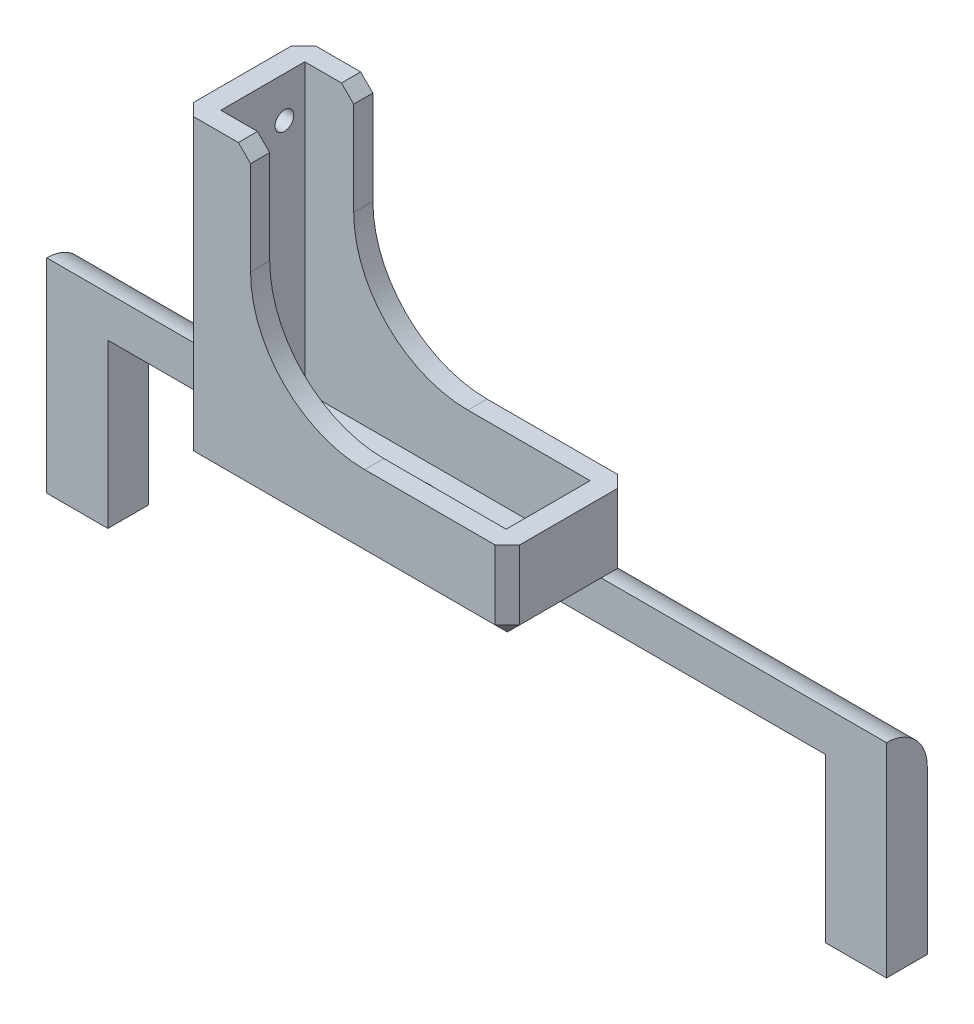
ISO-10303-21;
HEADER;
FILE_DESCRIPTION(('STEP AP214'),'2;1');
FILE_NAME('part.step','',(''),(''),'','','');
FILE_SCHEMA(('AUTOMOTIVE_DESIGN { 1 0 10303 214 1 1 1 1 }'));
ENDSEC;
DATA;
#1=APPLICATION_CONTEXT('core data for automotive mechanical design processes');
#2=APPLICATION_PROTOCOL_DEFINITION('international standard','automotive_design',2000,#1);
#3=PRODUCT_CONTEXT('',#1,'mechanical');
#4=PRODUCT('Part','Part','',(#3));
#5=PRODUCT_RELATED_PRODUCT_CATEGORY('part','',(#4));
#6=PRODUCT_DEFINITION_FORMATION('','',#4);
#7=PRODUCT_DEFINITION_CONTEXT('part definition',#1,'design');
#8=PRODUCT_DEFINITION('design','',#6,#7);
#9=PRODUCT_DEFINITION_SHAPE('','',#8);
#10=(LENGTH_UNIT() NAMED_UNIT(*) SI_UNIT(.MILLI.,.METRE.));
#11=(NAMED_UNIT(*) PLANE_ANGLE_UNIT() SI_UNIT($,.RADIAN.));
#12=(NAMED_UNIT(*) SI_UNIT($,.STERADIAN.) SOLID_ANGLE_UNIT());
#13=UNCERTAINTY_MEASURE_WITH_UNIT(LENGTH_MEASURE(1.E-05),#10,'distance_accuracy_value','');
#14=(GEOMETRIC_REPRESENTATION_CONTEXT(3) GLOBAL_UNCERTAINTY_ASSIGNED_CONTEXT((#13)) GLOBAL_UNIT_ASSIGNED_CONTEXT((#10,
#11,#12)) REPRESENTATION_CONTEXT('',''));
#15=CARTESIAN_POINT('',(0.,0.,0.));
#16=DIRECTION('',(0.,0.,1.));
#17=DIRECTION('',(1.,0.,0.));
#18=AXIS2_PLACEMENT_3D('',#15,#16,#17);
#19=CARTESIAN_POINT('',(0.,-2.,0.));
#20=DIRECTION('',(0.,1.,0.));
#21=DIRECTION('',(0.,0.,1.));
#22=AXIS2_PLACEMENT_3D('',#19,#20,#21);
#23=PLANE('',#22);
#24=DIRECTION('',(0.,0.,-1.));
#25=VECTOR('',#24,1.);
#26=CARTESIAN_POINT('',(44.,-2.,-9.00000000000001));
#27=LINE('',#26,#25);
#28=CARTESIAN_POINT('',(44.,-2.,-4.00000000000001));
#29=VERTEX_POINT('',#28);
#30=CARTESIAN_POINT('',(44.,-2.,-9.00000000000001));
#31=VERTEX_POINT('',#30);
#32=EDGE_CURVE('E339',#29,#31,#27,.T.);
#33=ORIENTED_EDGE('',*,*,#32,.F.);
#34=DIRECTION('',(-1.,0.,0.));
#35=VECTOR('',#34,1.);
#36=CARTESIAN_POINT('',(-7.50000000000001,-2.,-4.00000000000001));
#37=LINE('',#36,#35);
#38=CARTESIAN_POINT('',(-44.,-2.,-4.00000000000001));
#39=VERTEX_POINT('',#38);
#40=EDGE_CURVE('E1004',#29,#39,#37,.T.);
#41=ORIENTED_EDGE('',*,*,#40,.T.);
#42=DIRECTION('',(0.,0.,1.));
#43=VECTOR('',#42,1.);
#44=CARTESIAN_POINT('',(-44.,-2.,-8.99999999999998));
#45=LINE('',#44,#43);
#46=CARTESIAN_POINT('',(-44.,-1.99999999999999,-8.99999999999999));
#47=VERTEX_POINT('',#46);
#48=EDGE_CURVE('E73',#47,#39,#45,.T.);
#49=ORIENTED_EDGE('',*,*,#48,.F.);
#50=DIRECTION('',(1.,0.,0.));
#51=VECTOR('',#50,1.);
#52=CARTESIAN_POINT('',(-35.6780056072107,-1.99999999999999,-8.99999999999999));
#53=LINE('',#52,#51);
#54=EDGE_CURVE('E361',#47,#31,#53,.T.);
#55=ORIENTED_EDGE('',*,*,#54,.T.);
#56=EDGE_LOOP('',(#33,#41,#49,#55));
#57=FACE_BOUND('',#56,.T.);
#58=ADVANCED_FACE('F51',(#57),#23,.F.);
#59=CARTESIAN_POINT('',(-7.5,7.,-4.));
#60=DIRECTION('',(1.,0.,0.));
#61=DIRECTION('',(0.,0.,-1.));
#62=AXIS2_PLACEMENT_3D('',#59,#60,#61);
#63=PLANE('',#62);
#64=DIRECTION('',(0.,1.,0.));
#65=VECTOR('',#64,1.);
#66=CARTESIAN_POINT('',(-7.5,3.00000000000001,-3.99999999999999));
#67=LINE('',#66,#65);
#68=CARTESIAN_POINT('',(-7.5,0.,-4.00000000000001));
#69=VERTEX_POINT('',#68);
#70=CARTESIAN_POINT('',(-7.5,3.00000000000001,-3.99999999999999));
#71=VERTEX_POINT('',#70);
#72=EDGE_CURVE('E1009',#69,#71,#67,.T.);
#73=ORIENTED_EDGE('',*,*,#72,.F.);
#74=CARTESIAN_POINT('',(-7.5,10.6437465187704,-3.42890494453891));
#75=DIRECTION('',(1.,0.,0.));
#76=DIRECTION('',(0.,0.,-1.));
#77=AXIS2_PLACEMENT_3D('',#74,#75,#76);
#78=CIRCLE('',#77,10.6590566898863);
#79=CARTESIAN_POINT('',(-7.5,3.00000000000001,4.));
#80=VERTEX_POINT('',#79);
#81=EDGE_CURVE('E385',#69,#80,#78,.F.);
#82=ORIENTED_EDGE('',*,*,#81,.T.);
#83=DIRECTION('',(0.,-1.,0.));
#84=VECTOR('',#83,1.);
#85=CARTESIAN_POINT('',(-7.5,7.,4.));
#86=LINE('',#85,#84);
#87=CARTESIAN_POINT('',(-7.5,3.5,4.));
#88=VERTEX_POINT('',#87);
#89=EDGE_CURVE('E477',#88,#80,#86,.T.);
#90=ORIENTED_EDGE('',*,*,#89,.F.);
#91=DIRECTION('',(0.,0.,-1.));
#92=VECTOR('',#91,1.);
#93=CARTESIAN_POINT('',(-7.5,3.5,-4.));
#94=LINE('',#93,#92);
#95=CARTESIAN_POINT('',(-7.5,3.5,-4.));
#96=VERTEX_POINT('',#95);
#97=EDGE_CURVE('E587',#88,#96,#94,.T.);
#98=ORIENTED_EDGE('',*,*,#97,.T.);
#99=DIRECTION('',(0.,-1.,0.));
#100=VECTOR('',#99,1.);
#101=CARTESIAN_POINT('',(-7.5,7.,-4.));
#102=LINE('',#101,#100);
#103=EDGE_CURVE('E480',#96,#71,#102,.T.);
#104=ORIENTED_EDGE('',*,*,#103,.T.);
#105=EDGE_LOOP('',(#73,#82,#90,#98,#104));
#106=FACE_BOUND('',#105,.T.);
#107=ADVANCED_FACE('F674',(#106),#63,.F.);
#108=CARTESIAN_POINT('',(0.,5.,0.));
#109=DIRECTION('',(0.,1.,0.));
#110=DIRECTION('',(0.,0.,1.));
#111=AXIS2_PLACEMENT_3D('',#108,#109,#110);
#112=PLANE('',#111);
#113=DIRECTION('',(0.,0.,1.));
#114=VECTOR('',#113,1.);
#115=CARTESIAN_POINT('',(2.99999999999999,5.,4.));
#116=LINE('',#115,#114);
#117=CARTESIAN_POINT('',(2.99999999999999,5.,-4.));
#118=VERTEX_POINT('',#117);
#119=CARTESIAN_POINT('',(3.,4.99999999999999,3.59772233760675));
#120=VERTEX_POINT('',#119);
#121=EDGE_CURVE('E559',#118,#120,#116,.T.);
#122=ORIENTED_EDGE('',*,*,#121,.T.);
#123=CARTESIAN_POINT('',(0.,5.,3.59772233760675));
#124=DIRECTION('',(0.,1.,0.));
#125=DIRECTION('',(0.,0.,1.));
#126=AXIS2_PLACEMENT_3D('',#123,#124,#125);
#127=CIRCLE('',#126,3.);
#128=CARTESIAN_POINT('',(-3.,4.99999999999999,3.59772233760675));
#129=VERTEX_POINT('',#128);
#130=EDGE_CURVE('E80',#120,#129,#127,.T.);
#131=ORIENTED_EDGE('',*,*,#130,.T.);
#132=DIRECTION('',(0.,0.,-1.));
#133=VECTOR('',#132,1.);
#134=CARTESIAN_POINT('',(-3.,5.,-4.));
#135=LINE('',#134,#133);
#136=CARTESIAN_POINT('',(-3.,5.,-4.));
#137=VERTEX_POINT('',#136);
#138=EDGE_CURVE('E562',#129,#137,#135,.T.);
#139=ORIENTED_EDGE('',*,*,#138,.T.);
#140=DIRECTION('',(-1.,0.,0.));
#141=VECTOR('',#140,1.);
#142=CARTESIAN_POINT('',(-7.5,5.,-4.));
#143=LINE('',#142,#141);
#144=EDGE_CURVE('E397',#118,#137,#143,.T.);
#145=ORIENTED_EDGE('',*,*,#144,.F.);
#146=EDGE_LOOP('',(#122,#131,#139,#145));
#147=FACE_BOUND('',#146,.T.);
#148=ADVANCED_FACE('F810',(#147),#112,.F.);
#149=CARTESIAN_POINT('',(-7.5,7.,4.));
#150=DIRECTION('',(0.,0.,-1.));
#151=DIRECTION('',(-1.,0.,0.));
#152=AXIS2_PLACEMENT_3D('',#149,#150,#151);
#153=PLANE('',#152);
#154=ORIENTED_EDGE('',*,*,#89,.T.);
#155=DIRECTION('',(1.,0.,0.));
#156=VECTOR('',#155,1.);
#157=CARTESIAN_POINT('',(-12.5,3.00000000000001,4.00000000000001));
#158=LINE('',#157,#156);
#159=CARTESIAN_POINT('',(-4.5,3.00000000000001,4.));
#160=VERTEX_POINT('',#159);
#161=EDGE_CURVE('E380',#80,#160,#158,.T.);
#162=ORIENTED_EDGE('',*,*,#161,.T.);
#163=DIRECTION('',(0.,1.,0.));
#164=VECTOR('',#163,1.);
#165=CARTESIAN_POINT('',(-4.5,7.,4.));
#166=LINE('',#165,#164);
#167=CARTESIAN_POINT('',(-4.5,3.5,4.));
#168=VERTEX_POINT('',#167);
#169=EDGE_CURVE('E403',#160,#168,#166,.T.);
#170=ORIENTED_EDGE('',*,*,#169,.T.);
#171=DIRECTION('',(-1.,0.,0.));
#172=VECTOR('',#171,1.);
#173=CARTESIAN_POINT('',(-7.5,3.5,4.));
#174=LINE('',#173,#172);
#175=EDGE_CURVE('E591',#168,#88,#174,.T.);
#176=ORIENTED_EDGE('',*,*,#175,.T.);
#177=EDGE_LOOP('',(#154,#162,#170,#176));
#178=FACE_BOUND('',#177,.T.);
#179=ADVANCED_FACE('F669',(#178),#153,.F.);
#180=CARTESIAN_POINT('',(20.001,37.,0.85));
#181=DIRECTION('',(-1.,0.,0.));
#182=DIRECTION('',(0.,0.,1.));
#183=AXIS2_PLACEMENT_3D('',#180,#181,#182);
#184=CYLINDRICAL_SURFACE('',#183,1.15);
#185=CARTESIAN_POINT('',(-17.5,37.,0.85));
#186=DIRECTION('',(1.,0.,0.));
#187=DIRECTION('',(0.,0.,-1.));
#188=AXIS2_PLACEMENT_3D('',#185,#186,#187);
#189=CIRCLE('',#188,1.15);
#190=CARTESIAN_POINT('',(-17.5,37.,-0.299999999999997));
#191=VERTEX_POINT('',#190);
#192=EDGE_CURVE('E417',#191,#191,#189,.F.);
#193=ORIENTED_EDGE('',*,*,#192,.F.);
#194=EDGE_LOOP('',(#193));
#195=FACE_BOUND('',#194,.T.);
#196=CARTESIAN_POINT('',(-19.9,37.,0.85));
#197=DIRECTION('',(-1.,0.,0.));
#198=DIRECTION('',(0.,0.,1.));
#199=AXIS2_PLACEMENT_3D('',#196,#197,#198);
#200=CIRCLE('',#199,1.15);
#201=CARTESIAN_POINT('',(-19.9,37.,2.));
#202=VERTEX_POINT('',#201);
#203=EDGE_CURVE('E414',#202,#202,#200,.F.);
#204=ORIENTED_EDGE('',*,*,#203,.F.);
#205=EDGE_LOOP('',(#204));
#206=FACE_BOUND('',#205,.T.);
#207=ADVANCED_FACE('F818',(#195,#206),#184,.F.);
#208=CARTESIAN_POINT('',(7.5,7.,-4.));
#209=DIRECTION('',(-1.,0.,0.));
#210=DIRECTION('',(0.,0.,1.));
#211=AXIS2_PLACEMENT_3D('',#208,#209,#210);
#212=PLANE('',#211);
#213=DIRECTION('',(0.,-1.,0.));
#214=VECTOR('',#213,1.);
#215=CARTESIAN_POINT('',(7.5,-1.99999999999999,-4.));
#216=LINE('',#215,#214);
#217=CARTESIAN_POINT('',(7.5,3.00000000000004,-4.));
#218=VERTEX_POINT('',#217);
#219=CARTESIAN_POINT('',(7.5,0.,-4.));
#220=VERTEX_POINT('',#219);
#221=EDGE_CURVE('E1017',#218,#220,#216,.T.);
#222=ORIENTED_EDGE('',*,*,#221,.F.);
#223=DIRECTION('',(0.,-1.,0.));
#224=VECTOR('',#223,1.);
#225=CARTESIAN_POINT('',(7.5,7.,-4.));
#226=LINE('',#225,#224);
#227=CARTESIAN_POINT('',(7.5,3.50000000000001,-4.));
#228=VERTEX_POINT('',#227);
#229=EDGE_CURVE('E483',#228,#218,#226,.T.);
#230=ORIENTED_EDGE('',*,*,#229,.F.);
#231=DIRECTION('',(0.,0.,1.));
#232=VECTOR('',#231,1.);
#233=CARTESIAN_POINT('',(7.5,3.50000000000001,4.));
#234=LINE('',#233,#232);
#235=CARTESIAN_POINT('',(7.5,3.50000000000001,4.));
#236=VERTEX_POINT('',#235);
#237=EDGE_CURVE('E599',#228,#236,#234,.T.);
#238=ORIENTED_EDGE('',*,*,#237,.T.);
#239=DIRECTION('',(0.,-1.,0.));
#240=VECTOR('',#239,1.);
#241=CARTESIAN_POINT('',(7.5,7.,4.));
#242=LINE('',#241,#240);
#243=CARTESIAN_POINT('',(7.5,3.00000000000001,4.));
#244=VERTEX_POINT('',#243);
#245=EDGE_CURVE('E475',#236,#244,#242,.T.);
#246=ORIENTED_EDGE('',*,*,#245,.T.);
#247=CARTESIAN_POINT('',(7.5,10.6437465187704,-3.42890494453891));
#248=DIRECTION('',(1.,0.,0.));
#249=DIRECTION('',(0.,0.,-1.));
#250=AXIS2_PLACEMENT_3D('',#247,#248,#249);
#251=CIRCLE('',#250,10.6590566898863);
#252=EDGE_CURVE('E372',#244,#220,#251,.T.);
#253=ORIENTED_EDGE('',*,*,#252,.T.);
#254=EDGE_LOOP('',(#222,#230,#238,#246,#253));
#255=FACE_BOUND('',#254,.T.);
#256=ADVANCED_FACE('F776',(#255),#212,.F.);
#257=DIRECTION('',(0.,-1.,0.));
#258=VECTOR('',#257,1.);
#259=CARTESIAN_POINT('',(4.49999999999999,7.,4.));
#260=LINE('',#259,#258);
#261=CARTESIAN_POINT('',(4.49999999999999,3.50000000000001,4.));
#262=VERTEX_POINT('',#261);
#263=CARTESIAN_POINT('',(4.49999999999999,3.00000000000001,4.));
#264=VERTEX_POINT('',#263);
#265=EDGE_CURVE('E407',#262,#264,#260,.T.);
#266=ORIENTED_EDGE('',*,*,#265,.T.);
#267=EDGE_CURVE('E377',#264,#244,#158,.T.);
#268=ORIENTED_EDGE('',*,*,#267,.T.);
#269=ORIENTED_EDGE('',*,*,#245,.F.);
#270=DIRECTION('',(-1.,0.,0.));
#271=VECTOR('',#270,1.);
#272=CARTESIAN_POINT('',(4.5,3.50000000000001,4.));
#273=LINE('',#272,#271);
#274=EDGE_CURVE('E589',#236,#262,#273,.T.);
#275=ORIENTED_EDGE('',*,*,#274,.T.);
#276=EDGE_LOOP('',(#266,#268,#269,#275));
#277=FACE_BOUND('',#276,.T.);
#278=ADVANCED_FACE('F779',(#277),#153,.F.);
#279=CARTESIAN_POINT('',(-7.5,7.,-4.));
#280=DIRECTION('',(0.,0.,1.));
#281=DIRECTION('',(1.,0.,0.));
#282=AXIS2_PLACEMENT_3D('',#279,#280,#281);
#283=PLANE('',#282);
#284=ORIENTED_EDGE('',*,*,#229,.T.);
#285=DIRECTION('',(1.,0.,0.));
#286=VECTOR('',#285,1.);
#287=CARTESIAN_POINT('',(-12.5,3.00000000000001,-3.99999999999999));
#288=LINE('',#287,#286);
#289=CARTESIAN_POINT('',(4.5,3.00000000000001,-4.));
#290=VERTEX_POINT('',#289);
#291=EDGE_CURVE('E382',#290,#218,#288,.T.);
#292=ORIENTED_EDGE('',*,*,#291,.F.);
#293=DIRECTION('',(0.,1.,0.));
#294=VECTOR('',#293,1.);
#295=CARTESIAN_POINT('',(4.5,7.,-4.));
#296=LINE('',#295,#294);
#297=CARTESIAN_POINT('',(4.5,3.50000000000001,-4.));
#298=VERTEX_POINT('',#297);
#299=EDGE_CURVE('E405',#290,#298,#296,.T.);
#300=ORIENTED_EDGE('',*,*,#299,.T.);
#301=DIRECTION('',(0.707106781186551,-0.707106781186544,0.));
#302=VECTOR('',#301,1.);
#303=CARTESIAN_POINT('',(-3.25000000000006,11.25,-4.));
#304=LINE('',#303,#302);
#305=EDGE_CURVE('E605',#298,#118,#304,.F.);
#306=ORIENTED_EDGE('',*,*,#305,.T.);
#307=ORIENTED_EDGE('',*,*,#144,.T.);
#308=DIRECTION('',(0.707106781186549,0.707106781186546,0.));
#309=VECTOR('',#308,1.);
#310=CARTESIAN_POINT('',(-4.25000000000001,3.74999999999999,-4.));
#311=LINE('',#310,#309);
#312=CARTESIAN_POINT('',(-4.5,3.5,-4.));
#313=VERTEX_POINT('',#312);
#314=EDGE_CURVE('E603',#137,#313,#311,.F.);
#315=ORIENTED_EDGE('',*,*,#314,.T.);
#316=DIRECTION('',(0.,-1.,0.));
#317=VECTOR('',#316,1.);
#318=CARTESIAN_POINT('',(-4.5,7.,-4.));
#319=LINE('',#318,#317);
#320=CARTESIAN_POINT('',(-4.5,3.00000000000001,-4.));
#321=VERTEX_POINT('',#320);
#322=EDGE_CURVE('E400',#313,#321,#319,.T.);
#323=ORIENTED_EDGE('',*,*,#322,.T.);
#324=EDGE_CURVE('E381',#71,#321,#288,.T.);
#325=ORIENTED_EDGE('',*,*,#324,.F.);
#326=ORIENTED_EDGE('',*,*,#103,.F.);
#327=DIRECTION('',(0.707106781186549,-0.707106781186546,0.));
#328=VECTOR('',#327,1.);
#329=CARTESIAN_POINT('',(-9.25000000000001,5.24999999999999,-4.));
#330=LINE('',#329,#328);
#331=CARTESIAN_POINT('',(-9.00000000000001,5.,-4.));
#332=VERTEX_POINT('',#331);
#333=EDGE_CURVE('E601',#96,#332,#330,.F.);
#334=ORIENTED_EDGE('',*,*,#333,.T.);
#335=DIRECTION('',(-1.,0.,0.));
#336=VECTOR('',#335,1.);
#337=CARTESIAN_POINT('',(-20.,5.,-4.));
#338=LINE('',#337,#336);
#339=CARTESIAN_POINT('',(-18.5,5.,-4.));
#340=VERTEX_POINT('',#339);
#341=EDGE_CURVE('E471',#332,#340,#338,.T.);
#342=ORIENTED_EDGE('',*,*,#341,.T.);
#343=DIRECTION('',(0.,1.,0.));
#344=VECTOR('',#343,1.);
#345=CARTESIAN_POINT('',(-18.5,42.,-4.));
#346=LINE('',#345,#344);
#347=CARTESIAN_POINT('',(-18.5,42.,-4.));
#348=VERTEX_POINT('',#347);
#349=EDGE_CURVE('E539',#340,#348,#346,.T.);
#350=ORIENTED_EDGE('',*,*,#349,.T.);
#351=DIRECTION('',(-1.,0.,0.));
#352=VECTOR('',#351,1.);
#353=CARTESIAN_POINT('',(-20.,42.,-4.));
#354=LINE('',#353,#352);
#355=CARTESIAN_POINT('',(-13.,42.,-4.));
#356=VERTEX_POINT('',#355);
#357=EDGE_CURVE('E462',#356,#348,#354,.T.);
#358=ORIENTED_EDGE('',*,*,#357,.F.);
#359=DIRECTION('',(0.707106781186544,-0.707106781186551,0.));
#360=VECTOR('',#359,1.);
#361=CARTESIAN_POINT('',(-13.,42.,-4.));
#362=LINE('',#361,#360);
#363=CARTESIAN_POINT('',(-11.5,40.5,-4.));
#364=VERTEX_POINT('',#363);
#365=EDGE_CURVE('E541',#356,#364,#362,.T.);
#366=ORIENTED_EDGE('',*,*,#365,.T.);
#367=DIRECTION('',(0.,1.,0.));
#368=VECTOR('',#367,1.);
#369=CARTESIAN_POINT('',(-11.5,42.,-4.));
#370=LINE('',#369,#368);
#371=CARTESIAN_POINT('',(-11.5,29.,-4.));
#372=VERTEX_POINT('',#371);
#373=EDGE_CURVE('E424',#372,#364,#370,.T.);
#374=ORIENTED_EDGE('',*,*,#373,.F.);
#375=CARTESIAN_POINT('',(2.5,29.,-4.));
#376=DIRECTION('',(0.,0.,1.));
#377=DIRECTION('',(1.,0.,0.));
#378=AXIS2_PLACEMENT_3D('',#375,#376,#377);
#379=CIRCLE('',#378,14.);
#380=CARTESIAN_POINT('',(2.5,15.,-4.));
#381=VERTEX_POINT('',#380);
#382=EDGE_CURVE('E509',#372,#381,#379,.T.);
#383=ORIENTED_EDGE('',*,*,#382,.T.);
#384=DIRECTION('',(-1.,0.,0.));
#385=VECTOR('',#384,1.);
#386=CARTESIAN_POINT('',(11.5,15.,-4.));
#387=LINE('',#386,#385);
#388=CARTESIAN_POINT('',(18.5,15.,-4.));
#389=VERTEX_POINT('',#388);
#390=EDGE_CURVE('E420',#389,#381,#387,.T.);
#391=ORIENTED_EDGE('',*,*,#390,.F.);
#392=DIRECTION('',(0.,-1.,0.));
#393=VECTOR('',#392,1.);
#394=CARTESIAN_POINT('',(18.5,5.,-4.));
#395=LINE('',#394,#393);
#396=CARTESIAN_POINT('',(18.5,5.,-4.));
#397=VERTEX_POINT('',#396);
#398=EDGE_CURVE('E537',#389,#397,#395,.T.);
#399=ORIENTED_EDGE('',*,*,#398,.T.);
#400=CARTESIAN_POINT('',(9.,5.,-4.));
#401=VERTEX_POINT('',#400);
#402=EDGE_CURVE('E474',#397,#401,#338,.T.);
#403=ORIENTED_EDGE('',*,*,#402,.T.);
#404=DIRECTION('',(0.707106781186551,0.707106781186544,0.));
#405=VECTOR('',#404,1.);
#406=CARTESIAN_POINT('',(1.74999999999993,-2.25000000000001,-4.));
#407=LINE('',#406,#405);
#408=EDGE_CURVE('E607',#401,#228,#407,.F.);
#409=ORIENTED_EDGE('',*,*,#408,.T.);
#410=EDGE_LOOP('',(#284,#292,#300,#306,#307,#315,#323,#325,#326,#334,#342,#350,#358,#366,#374,
#383,#391,#399,#403,#409));
#411=FACE_BOUND('',#410,.T.);
#412=ADVANCED_FACE('F652',(#411),#283,.F.);
#413=CARTESIAN_POINT('',(-3.,5.,5.50000000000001));
#414=VERTEX_POINT('',#413);
#415=EDGE_CURVE('E563',#414,#129,#135,.T.);
#416=ORIENTED_EDGE('',*,*,#415,.T.);
#417=EDGE_CURVE('E789',#129,#120,#127,.T.);
#418=ORIENTED_EDGE('',*,*,#417,.T.);
#419=CARTESIAN_POINT('',(2.99999999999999,5.,5.5));
#420=VERTEX_POINT('',#419);
#421=EDGE_CURVE('E558',#120,#420,#116,.T.);
#422=ORIENTED_EDGE('',*,*,#421,.T.);
#423=DIRECTION('',(1.,0.,0.));
#424=VECTOR('',#423,1.);
#425=CARTESIAN_POINT('',(7.5,5.,5.5));
#426=LINE('',#425,#424);
#427=CARTESIAN_POINT('',(9.,5.,5.5));
#428=VERTEX_POINT('',#427);
#429=EDGE_CURVE('E556',#420,#428,#426,.T.);
#430=ORIENTED_EDGE('',*,*,#429,.T.);
#431=DIRECTION('',(0.,0.,-1.));
#432=VECTOR('',#431,1.);
#433=CARTESIAN_POINT('',(9.,5.,-4.));
#434=LINE('',#433,#432);
#435=EDGE_CURVE('E554',#428,#401,#434,.T.);
#436=ORIENTED_EDGE('',*,*,#435,.T.);
#437=ORIENTED_EDGE('',*,*,#402,.F.);
#438=DIRECTION('',(0.,0.,1.));
#439=VECTOR('',#438,1.);
#440=CARTESIAN_POINT('',(18.5,5.,11.));
#441=LINE('',#440,#439);
#442=CARTESIAN_POINT('',(18.5,5.,9.49999999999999));
#443=VERTEX_POINT('',#442);
#444=EDGE_CURVE('E571',#397,#443,#441,.T.);
#445=ORIENTED_EDGE('',*,*,#444,.T.);
#446=DIRECTION('',(-1.,0.,0.));
#447=VECTOR('',#446,1.);
#448=CARTESIAN_POINT('',(-20.,5.,9.49999999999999));
#449=LINE('',#448,#447);
#450=CARTESIAN_POINT('',(-18.5,5.,9.49999999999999));
#451=VERTEX_POINT('',#450);
#452=EDGE_CURVE('E573',#443,#451,#449,.T.);
#453=ORIENTED_EDGE('',*,*,#452,.T.);
#454=DIRECTION('',(0.,0.,-1.));
#455=VECTOR('',#454,1.);
#456=CARTESIAN_POINT('',(-18.5,5.,-4.));
#457=LINE('',#456,#455);
#458=EDGE_CURVE('E575',#451,#340,#457,.T.);
#459=ORIENTED_EDGE('',*,*,#458,.T.);
#460=ORIENTED_EDGE('',*,*,#341,.F.);
#461=DIRECTION('',(0.,0.,1.));
#462=VECTOR('',#461,1.);
#463=CARTESIAN_POINT('',(-9.00000000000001,5.,4.));
#464=LINE('',#463,#462);
#465=CARTESIAN_POINT('',(-9.00000000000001,5.,5.50000000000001));
#466=VERTEX_POINT('',#465);
#467=EDGE_CURVE('E568',#332,#466,#464,.T.);
#468=ORIENTED_EDGE('',*,*,#467,.T.);
#469=DIRECTION('',(1.,0.,0.));
#470=VECTOR('',#469,1.);
#471=CARTESIAN_POINT('',(-4.5,5.,5.50000000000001));
#472=LINE('',#471,#470);
#473=EDGE_CURVE('E566',#466,#414,#472,.T.);
#474=ORIENTED_EDGE('',*,*,#473,.T.);
#475=EDGE_LOOP('',(#416,#418,#422,#430,#436,#437,#445,#453,#459,#460,#468,#474));
#476=FACE_BOUND('',#475,.T.);
#477=ADVANCED_FACE('F683',(#476),#112,.F.);
#478=CARTESIAN_POINT('',(20.,5.,-4.));
#479=DIRECTION('',(1.,0.,0.));
#480=DIRECTION('',(0.,0.,-1.));
#481=AXIS2_PLACEMENT_3D('',#478,#479,#480);
#482=PLANE('',#481);
#483=DIRECTION('',(0.,0.,-1.));
#484=VECTOR('',#483,1.);
#485=CARTESIAN_POINT('',(20.,15.,-4.));
#486=LINE('',#485,#484);
#487=CARTESIAN_POINT('',(20.,15.,9.5));
#488=VERTEX_POINT('',#487);
#489=CARTESIAN_POINT('',(20.,15.,-2.5));
#490=VERTEX_POINT('',#489);
#491=EDGE_CURVE('E393',#488,#490,#486,.T.);
#492=ORIENTED_EDGE('',*,*,#491,.F.);
#493=DIRECTION('',(0.,-1.,0.));
#494=VECTOR('',#493,1.);
#495=CARTESIAN_POINT('',(20.,5.,9.5));
#496=LINE('',#495,#494);
#497=CARTESIAN_POINT('',(20.,6.5,9.5));
#498=VERTEX_POINT('',#497);
#499=EDGE_CURVE('E585',#488,#498,#496,.T.);
#500=ORIENTED_EDGE('',*,*,#499,.T.);
#501=DIRECTION('',(0.,0.,-1.));
#502=VECTOR('',#501,1.);
#503=CARTESIAN_POINT('',(20.,6.5,-4.));
#504=LINE('',#503,#502);
#505=CARTESIAN_POINT('',(20.,6.5,-2.5));
#506=VERTEX_POINT('',#505);
#507=EDGE_CURVE('E581',#498,#506,#504,.T.);
#508=ORIENTED_EDGE('',*,*,#507,.T.);
#509=DIRECTION('',(0.,1.,0.));
#510=VECTOR('',#509,1.);
#511=CARTESIAN_POINT('',(20.,15.,-2.5));
#512=LINE('',#511,#510);
#513=EDGE_CURVE('E583',#506,#490,#512,.T.);
#514=ORIENTED_EDGE('',*,*,#513,.T.);
#515=EDGE_LOOP('',(#492,#500,#508,#514));
#516=FACE_BOUND('',#515,.T.);
#517=ADVANCED_FACE('F824',(#516),#482,.T.);
#518=CARTESIAN_POINT('',(-20.,5.,11.));
#519=DIRECTION('',(0.,0.,1.));
#520=DIRECTION('',(1.,0.,0.));
#521=AXIS2_PLACEMENT_3D('',#518,#519,#520);
#522=PLANE('',#521);
#523=DIRECTION('',(0.,1.,0.));
#524=VECTOR('',#523,1.);
#525=CARTESIAN_POINT('',(-11.5,42.,11.));
#526=LINE('',#525,#524);
#527=CARTESIAN_POINT('',(-11.5,29.,11.));
#528=VERTEX_POINT('',#527);
#529=CARTESIAN_POINT('',(-11.5,40.5,11.));
#530=VERTEX_POINT('',#529);
#531=EDGE_CURVE('E423',#528,#530,#526,.T.);
#532=ORIENTED_EDGE('',*,*,#531,.T.);
#533=DIRECTION('',(-0.707106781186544,0.707106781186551,0.));
#534=VECTOR('',#533,1.);
#535=CARTESIAN_POINT('',(2.00000000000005,26.9999999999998,11.));
#536=LINE('',#535,#534);
#537=CARTESIAN_POINT('',(-13.,42.,11.));
#538=VERTEX_POINT('',#537);
#539=EDGE_CURVE('E535',#530,#538,#536,.T.);
#540=ORIENTED_EDGE('',*,*,#539,.T.);
#541=DIRECTION('',(1.,0.,0.));
#542=VECTOR('',#541,1.);
#543=CARTESIAN_POINT('',(-20.,42.,11.));
#544=LINE('',#543,#542);
#545=CARTESIAN_POINT('',(-18.5,42.,11.));
#546=VERTEX_POINT('',#545);
#547=EDGE_CURVE('E468',#546,#538,#544,.T.);
#548=ORIENTED_EDGE('',*,*,#547,.F.);
#549=DIRECTION('',(0.,-1.,0.));
#550=VECTOR('',#549,1.);
#551=CARTESIAN_POINT('',(-18.5,5.,11.));
#552=LINE('',#551,#550);
#553=CARTESIAN_POINT('',(-18.5,6.5,11.));
#554=VERTEX_POINT('',#553);
#555=EDGE_CURVE('E533',#546,#554,#552,.T.);
#556=ORIENTED_EDGE('',*,*,#555,.T.);
#557=DIRECTION('',(1.,0.,0.));
#558=VECTOR('',#557,1.);
#559=CARTESIAN_POINT('',(20.,6.5,11.));
#560=LINE('',#559,#558);
#561=CARTESIAN_POINT('',(18.5,6.5,11.));
#562=VERTEX_POINT('',#561);
#563=EDGE_CURVE('E531',#554,#562,#560,.T.);
#564=ORIENTED_EDGE('',*,*,#563,.T.);
#565=DIRECTION('',(0.,1.,0.));
#566=VECTOR('',#565,1.);
#567=CARTESIAN_POINT('',(18.5,5.,11.));
#568=LINE('',#567,#566);
#569=CARTESIAN_POINT('',(18.5,15.,11.));
#570=VERTEX_POINT('',#569);
#571=EDGE_CURVE('E529',#562,#570,#568,.T.);
#572=ORIENTED_EDGE('',*,*,#571,.T.);
#573=DIRECTION('',(-1.,0.,0.));
#574=VECTOR('',#573,1.);
#575=CARTESIAN_POINT('',(11.5,15.,11.));
#576=LINE('',#575,#574);
#577=CARTESIAN_POINT('',(2.5,15.,11.));
#578=VERTEX_POINT('',#577);
#579=EDGE_CURVE('E421',#570,#578,#576,.T.);
#580=ORIENTED_EDGE('',*,*,#579,.T.);
#581=CARTESIAN_POINT('',(2.5,29.,11.));
#582=DIRECTION('',(0.,0.,1.));
#583=DIRECTION('',(1.,0.,0.));
#584=AXIS2_PLACEMENT_3D('',#581,#582,#583);
#585=CIRCLE('',#584,14.);
#586=EDGE_CURVE('E507',#578,#528,#585,.F.);
#587=ORIENTED_EDGE('',*,*,#586,.T.);
#588=EDGE_LOOP('',(#532,#540,#548,#556,#564,#572,#580,#587));
#589=FACE_BOUND('',#588,.T.);
#590=ADVANCED_FACE('F883',(#589),#522,.T.);
#591=CARTESIAN_POINT('',(-20.,5.,-4.));
#592=DIRECTION('',(-1.,0.,0.));
#593=DIRECTION('',(0.,0.,1.));
#594=AXIS2_PLACEMENT_3D('',#591,#592,#593);
#595=PLANE('',#594);
#596=CARTESIAN_POINT('',(-20.,37.,0.85));
#597=DIRECTION('',(-1.,0.,0.));
#598=DIRECTION('',(0.,0.,1.));
#599=AXIS2_PLACEMENT_3D('',#596,#597,#598);
#600=CIRCLE('',#599,2.5);
#601=CARTESIAN_POINT('',(-20.,37.,3.35));
#602=VERTEX_POINT('',#601);
#603=EDGE_CURVE('E410',#602,#602,#600,.T.);
#604=ORIENTED_EDGE('',*,*,#603,.F.);
#605=EDGE_LOOP('',(#604));
#606=FACE_BOUND('',#605,.T.);
#607=DIRECTION('',(0.,0.,1.));
#608=VECTOR('',#607,1.);
#609=CARTESIAN_POINT('',(-20.,6.5,11.));
#610=LINE('',#609,#608);
#611=CARTESIAN_POINT('',(-20.,6.5,-2.49999999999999));
#612=VERTEX_POINT('',#611);
#613=CARTESIAN_POINT('',(-20.,6.5,9.5));
#614=VERTEX_POINT('',#613);
#615=EDGE_CURVE('E547',#612,#614,#610,.T.);
#616=ORIENTED_EDGE('',*,*,#615,.T.);
#617=DIRECTION('',(0.,1.,0.));
#618=VECTOR('',#617,1.);
#619=CARTESIAN_POINT('',(-20.,5.,9.5));
#620=LINE('',#619,#618);
#621=CARTESIAN_POINT('',(-20.,42.,9.5));
#622=VERTEX_POINT('',#621);
#623=EDGE_CURVE('E551',#614,#622,#620,.T.);
#624=ORIENTED_EDGE('',*,*,#623,.T.);
#625=DIRECTION('',(0.,0.,1.));
#626=VECTOR('',#625,1.);
#627=CARTESIAN_POINT('',(-20.,42.,-4.));
#628=LINE('',#627,#626);
#629=CARTESIAN_POINT('',(-20.,42.,-2.49999999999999));
#630=VERTEX_POINT('',#629);
#631=EDGE_CURVE('E465',#630,#622,#628,.T.);
#632=ORIENTED_EDGE('',*,*,#631,.F.);
#633=DIRECTION('',(0.,-1.,0.));
#634=VECTOR('',#633,1.);
#635=CARTESIAN_POINT('',(-20.,5.,-2.49999999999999));
#636=LINE('',#635,#634);
#637=EDGE_CURVE('E549',#630,#612,#636,.T.);
#638=ORIENTED_EDGE('',*,*,#637,.T.);
#639=EDGE_LOOP('',(#616,#624,#632,#638));
#640=FACE_BOUND('',#639,.T.);
#641=ADVANCED_FACE('F704',(#606,#640),#595,.T.);
#642=CARTESIAN_POINT('',(0.,42.,0.));
#643=DIRECTION('',(0.,1.,0.));
#644=DIRECTION('',(0.,0.,1.));
#645=AXIS2_PLACEMENT_3D('',#642,#643,#644);
#646=PLANE('',#645);
#647=ORIENTED_EDGE('',*,*,#547,.T.);
#648=DIRECTION('',(0.,0.,-1.));
#649=VECTOR('',#648,1.);
#650=CARTESIAN_POINT('',(-13.,42.,8.65));
#651=LINE('',#650,#649);
#652=CARTESIAN_POINT('',(-13.,42.,8.65));
#653=VERTEX_POINT('',#652);
#654=EDGE_CURVE('E522',#538,#653,#651,.T.);
#655=ORIENTED_EDGE('',*,*,#654,.T.);
#656=DIRECTION('',(1.,0.,0.));
#657=VECTOR('',#656,1.);
#658=CARTESIAN_POINT('',(-17.5,42.,8.65));
#659=LINE('',#658,#657);
#660=CARTESIAN_POINT('',(-17.5,42.,8.65));
#661=VERTEX_POINT('',#660);
#662=EDGE_CURVE('E441',#661,#653,#659,.T.);
#663=ORIENTED_EDGE('',*,*,#662,.F.);
#664=DIRECTION('',(0.,0.,1.));
#665=VECTOR('',#664,1.);
#666=CARTESIAN_POINT('',(-17.5,42.,-1.65));
#667=LINE('',#666,#665);
#668=CARTESIAN_POINT('',(-17.5,42.,-1.65));
#669=VERTEX_POINT('',#668);
#670=EDGE_CURVE('E437',#669,#661,#667,.T.);
#671=ORIENTED_EDGE('',*,*,#670,.F.);
#672=DIRECTION('',(-1.,0.,0.));
#673=VECTOR('',#672,1.);
#674=CARTESIAN_POINT('',(-17.5,42.,-1.65));
#675=LINE('',#674,#673);
#676=CARTESIAN_POINT('',(-13.,42.,-1.65));
#677=VERTEX_POINT('',#676);
#678=EDGE_CURVE('E435',#677,#669,#675,.T.);
#679=ORIENTED_EDGE('',*,*,#678,.F.);
#680=DIRECTION('',(0.,0.,-1.));
#681=VECTOR('',#680,1.);
#682=CARTESIAN_POINT('',(-13.,42.,-4.));
#683=LINE('',#682,#681);
#684=EDGE_CURVE('E519',#677,#356,#683,.T.);
#685=ORIENTED_EDGE('',*,*,#684,.T.);
#686=ORIENTED_EDGE('',*,*,#357,.T.);
#687=DIRECTION('',(-0.707106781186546,0.,0.707106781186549));
#688=VECTOR('',#687,1.);
#689=CARTESIAN_POINT('',(-11.25,42.,-11.25));
#690=LINE('',#689,#688);
#691=EDGE_CURVE('E515',#348,#630,#690,.T.);
#692=ORIENTED_EDGE('',*,*,#691,.T.);
#693=ORIENTED_EDGE('',*,*,#631,.T.);
#694=DIRECTION('',(-0.707106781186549,0.,-0.707106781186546));
#695=VECTOR('',#694,1.);
#696=CARTESIAN_POINT('',(-14.75,42.,14.75));
#697=LINE('',#696,#695);
#698=EDGE_CURVE('E517',#622,#546,#697,.F.);
#699=ORIENTED_EDGE('',*,*,#698,.T.);
#700=EDGE_LOOP('',(#647,#655,#663,#671,#679,#685,#686,#692,#693,#699));
#701=FACE_BOUND('',#700,.T.);
#702=ADVANCED_FACE('F707',(#701),#646,.T.);
#703=CARTESIAN_POINT('',(17.5,42.,-1.65));
#704=DIRECTION('',(-1.,0.,0.));
#705=DIRECTION('',(0.,0.,1.));
#706=AXIS2_PLACEMENT_3D('',#703,#704,#705);
#707=PLANE('',#706);
#708=DIRECTION('',(0.,0.,1.));
#709=VECTOR('',#708,1.);
#710=CARTESIAN_POINT('',(17.5,15.,-1.65));
#711=LINE('',#710,#709);
#712=CARTESIAN_POINT('',(17.5,15.,-1.65));
#713=VERTEX_POINT('',#712);
#714=CARTESIAN_POINT('',(17.5,15.,8.65));
#715=VERTEX_POINT('',#714);
#716=EDGE_CURVE('E390',#713,#715,#711,.T.);
#717=ORIENTED_EDGE('',*,*,#716,.F.);
#718=DIRECTION('',(0.,-1.,0.));
#719=VECTOR('',#718,1.);
#720=CARTESIAN_POINT('',(17.5,42.,-1.65));
#721=LINE('',#720,#719);
#722=CARTESIAN_POINT('',(17.5,7.,-1.65));
#723=VERTEX_POINT('',#722);
#724=EDGE_CURVE('E460',#713,#723,#721,.T.);
#725=ORIENTED_EDGE('',*,*,#724,.T.);
#726=DIRECTION('',(0.,0.,-1.));
#727=VECTOR('',#726,1.);
#728=CARTESIAN_POINT('',(17.5,7.,-1.65));
#729=LINE('',#728,#727);
#730=CARTESIAN_POINT('',(17.5,7.,8.65));
#731=VERTEX_POINT('',#730);
#732=EDGE_CURVE('E434',#731,#723,#729,.T.);
#733=ORIENTED_EDGE('',*,*,#732,.F.);
#734=DIRECTION('',(0.,-1.,0.));
#735=VECTOR('',#734,1.);
#736=CARTESIAN_POINT('',(17.5,42.,8.65));
#737=LINE('',#736,#735);
#738=EDGE_CURVE('E444',#715,#731,#737,.T.);
#739=ORIENTED_EDGE('',*,*,#738,.F.);
#740=EDGE_LOOP('',(#717,#725,#733,#739));
#741=FACE_BOUND('',#740,.T.);
#742=ADVANCED_FACE('F742',(#741),#707,.T.);
#743=CARTESIAN_POINT('',(-17.5,42.,-1.65));
#744=DIRECTION('',(0.,0.,1.));
#745=DIRECTION('',(1.,0.,0.));
#746=AXIS2_PLACEMENT_3D('',#743,#744,#745);
#747=PLANE('',#746);
#748=DIRECTION('',(0.,-1.,0.));
#749=VECTOR('',#748,1.);
#750=CARTESIAN_POINT('',(-11.5,42.,-1.65));
#751=LINE('',#750,#749);
#752=CARTESIAN_POINT('',(-11.5,40.5,-1.65));
#753=VERTEX_POINT('',#752);
#754=CARTESIAN_POINT('',(-11.5,29.,-1.65));
#755=VERTEX_POINT('',#754);
#756=EDGE_CURVE('E432',#753,#755,#751,.T.);
#757=ORIENTED_EDGE('',*,*,#756,.F.);
#758=DIRECTION('',(-0.707106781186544,0.707106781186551,0.));
#759=VECTOR('',#758,1.);
#760=CARTESIAN_POINT('',(-15.25,44.25,-1.65));
#761=LINE('',#760,#759);
#762=EDGE_CURVE('E545',#753,#677,#761,.T.);
#763=ORIENTED_EDGE('',*,*,#762,.T.);
#764=ORIENTED_EDGE('',*,*,#678,.T.);
#765=DIRECTION('',(0.,-1.,0.));
#766=VECTOR('',#765,1.);
#767=CARTESIAN_POINT('',(-17.5,42.,-1.65));
#768=LINE('',#767,#766);
#769=CARTESIAN_POINT('',(-17.5,7.,-1.65));
#770=VERTEX_POINT('',#769);
#771=EDGE_CURVE('E457',#669,#770,#768,.T.);
#772=ORIENTED_EDGE('',*,*,#771,.T.);
#773=DIRECTION('',(-1.,0.,0.));
#774=VECTOR('',#773,1.);
#775=CARTESIAN_POINT('',(-17.5,7.,-1.65));
#776=LINE('',#775,#774);
#777=EDGE_CURVE('E447',#723,#770,#776,.T.);
#778=ORIENTED_EDGE('',*,*,#777,.F.);
#779=ORIENTED_EDGE('',*,*,#724,.F.);
#780=DIRECTION('',(1.,0.,0.));
#781=VECTOR('',#780,1.);
#782=CARTESIAN_POINT('',(-17.5,15.,-1.65));
#783=LINE('',#782,#781);
#784=CARTESIAN_POINT('',(2.50000000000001,15.,-1.65));
#785=VERTEX_POINT('',#784);
#786=EDGE_CURVE('E427',#785,#713,#783,.T.);
#787=ORIENTED_EDGE('',*,*,#786,.F.);
#788=CARTESIAN_POINT('',(2.5,29.,-1.65));
#789=DIRECTION('',(0.,0.,1.));
#790=DIRECTION('',(1.,0.,0.));
#791=AXIS2_PLACEMENT_3D('',#788,#789,#790);
#792=CIRCLE('',#791,14.);
#793=EDGE_CURVE('E512',#785,#755,#792,.F.);
#794=ORIENTED_EDGE('',*,*,#793,.T.);
#795=EDGE_LOOP('',(#757,#763,#764,#772,#778,#779,#787,#794));
#796=FACE_BOUND('',#795,.T.);
#797=ADVANCED_FACE('F725',(#796),#747,.T.);
#798=CARTESIAN_POINT('',(-17.5,42.,-1.65));
#799=DIRECTION('',(1.,0.,0.));
#800=DIRECTION('',(0.,0.,-1.));
#801=AXIS2_PLACEMENT_3D('',#798,#799,#800);
#802=PLANE('',#801);
#803=ORIENTED_EDGE('',*,*,#192,.T.);
#804=EDGE_LOOP('',(#803));
#805=FACE_BOUND('',#804,.T.);
#806=DIRECTION('',(0.,0.,1.));
#807=VECTOR('',#806,1.);
#808=CARTESIAN_POINT('',(-17.5,7.,-1.65));
#809=LINE('',#808,#807);
#810=CARTESIAN_POINT('',(-17.5,7.,8.65));
#811=VERTEX_POINT('',#810);
#812=EDGE_CURVE('E449',#770,#811,#809,.T.);
#813=ORIENTED_EDGE('',*,*,#812,.F.);
#814=ORIENTED_EDGE('',*,*,#771,.F.);
#815=ORIENTED_EDGE('',*,*,#670,.T.);
#816=DIRECTION('',(0.,-1.,0.));
#817=VECTOR('',#816,1.);
#818=CARTESIAN_POINT('',(-17.5,42.,8.65));
#819=LINE('',#818,#817);
#820=EDGE_CURVE('E454',#661,#811,#819,.T.);
#821=ORIENTED_EDGE('',*,*,#820,.T.);
#822=EDGE_LOOP('',(#813,#814,#815,#821));
#823=FACE_BOUND('',#822,.T.);
#824=ADVANCED_FACE('F731',(#805,#823),#802,.T.);
#825=CARTESIAN_POINT('',(-17.5,42.,8.65));
#826=DIRECTION('',(0.,0.,-1.));
#827=DIRECTION('',(-1.,0.,0.));
#828=AXIS2_PLACEMENT_3D('',#825,#826,#827);
#829=PLANE('',#828);
#830=ORIENTED_EDGE('',*,*,#662,.T.);
#831=DIRECTION('',(0.707106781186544,-0.707106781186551,0.));
#832=VECTOR('',#831,1.);
#833=CARTESIAN_POINT('',(-15.25,44.25,8.65));
#834=LINE('',#833,#832);
#835=CARTESIAN_POINT('',(-11.5,40.5,8.65));
#836=VERTEX_POINT('',#835);
#837=EDGE_CURVE('E525',#653,#836,#834,.T.);
#838=ORIENTED_EDGE('',*,*,#837,.T.);
#839=DIRECTION('',(0.,1.,0.));
#840=VECTOR('',#839,1.);
#841=CARTESIAN_POINT('',(-11.5,42.,8.65));
#842=LINE('',#841,#840);
#843=CARTESIAN_POINT('',(-11.5,29.,8.65));
#844=VERTEX_POINT('',#843);
#845=EDGE_CURVE('E489',#844,#836,#842,.T.);
#846=ORIENTED_EDGE('',*,*,#845,.F.);
#847=CARTESIAN_POINT('',(2.5,29.,8.65));
#848=DIRECTION('',(0.,0.,-1.));
#849=DIRECTION('',(-1.,0.,0.));
#850=AXIS2_PLACEMENT_3D('',#847,#848,#849);
#851=CIRCLE('',#850,14.);
#852=CARTESIAN_POINT('',(2.5,15.,8.65));
#853=VERTEX_POINT('',#852);
#854=EDGE_CURVE('E505',#844,#853,#851,.F.);
#855=ORIENTED_EDGE('',*,*,#854,.T.);
#856=DIRECTION('',(-1.,0.,0.));
#857=VECTOR('',#856,1.);
#858=CARTESIAN_POINT('',(-17.5,15.,8.65));
#859=LINE('',#858,#857);
#860=EDGE_CURVE('E486',#715,#853,#859,.T.);
#861=ORIENTED_EDGE('',*,*,#860,.F.);
#862=ORIENTED_EDGE('',*,*,#738,.T.);
#863=DIRECTION('',(1.,0.,0.));
#864=VECTOR('',#863,1.);
#865=CARTESIAN_POINT('',(-17.5,7.,8.65));
#866=LINE('',#865,#864);
#867=EDGE_CURVE('E438',#811,#731,#866,.T.);
#868=ORIENTED_EDGE('',*,*,#867,.F.);
#869=ORIENTED_EDGE('',*,*,#820,.F.);
#870=EDGE_LOOP('',(#830,#838,#846,#855,#861,#862,#868,#869));
#871=FACE_BOUND('',#870,.T.);
#872=ADVANCED_FACE('F869',(#871),#829,.T.);
#873=CARTESIAN_POINT('',(0.,7.,0.));
#874=DIRECTION('',(0.,1.,0.));
#875=DIRECTION('',(0.,0.,1.));
#876=AXIS2_PLACEMENT_3D('',#873,#874,#875);
#877=PLANE('',#876);
#878=CARTESIAN_POINT('',(0.,7.,3.59772233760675));
#879=DIRECTION('',(0.,1.,0.));
#880=DIRECTION('',(0.,0.,1.));
#881=AXIS2_PLACEMENT_3D('',#878,#879,#880);
#882=CIRCLE('',#881,3.);
#883=CARTESIAN_POINT('',(0.,7.,6.59772233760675));
#884=VERTEX_POINT('',#883);
#885=EDGE_CURVE('E999',#884,#884,#882,.T.);
#886=ORIENTED_EDGE('',*,*,#885,.F.);
#887=EDGE_LOOP('',(#886));
#888=FACE_BOUND('',#887,.T.);
#889=ORIENTED_EDGE('',*,*,#732,.T.);
#890=ORIENTED_EDGE('',*,*,#777,.T.);
#891=ORIENTED_EDGE('',*,*,#812,.T.);
#892=ORIENTED_EDGE('',*,*,#867,.T.);
#893=EDGE_LOOP('',(#889,#890,#891,#892));
#894=FACE_BOUND('',#893,.T.);
#895=ADVANCED_FACE('F737',(#888,#894),#877,.T.);
#896=CARTESIAN_POINT('',(-11.5,42.,11.));
#897=DIRECTION('',(-1.,0.,0.));
#898=DIRECTION('',(0.,-1.,0.));
#899=AXIS2_PLACEMENT_3D('',#896,#897,#898);
#900=PLANE('',#899);
#901=ORIENTED_EDGE('',*,*,#845,.T.);
#902=DIRECTION('',(0.,0.,1.));
#903=VECTOR('',#902,1.);
#904=CARTESIAN_POINT('',(-11.5,40.5,11.));
#905=LINE('',#904,#903);
#906=EDGE_CURVE('E527',#836,#530,#905,.T.);
#907=ORIENTED_EDGE('',*,*,#906,.T.);
#908=ORIENTED_EDGE('',*,*,#531,.F.);
#909=DIRECTION('',(0.,0.,-1.));
#910=VECTOR('',#909,1.);
#911=CARTESIAN_POINT('',(-11.5,29.,8.65));
#912=LINE('',#911,#910);
#913=EDGE_CURVE('E492',#528,#844,#912,.T.);
#914=ORIENTED_EDGE('',*,*,#913,.T.);
#915=EDGE_LOOP('',(#901,#907,#908,#914));
#916=FACE_BOUND('',#915,.T.);
#917=ADVANCED_FACE('F863',(#916),#900,.F.);
#918=ORIENTED_EDGE('',*,*,#373,.T.);
#919=DIRECTION('',(0.,0.,1.));
#920=VECTOR('',#919,1.);
#921=CARTESIAN_POINT('',(-11.5,40.5,-1.65));
#922=LINE('',#921,#920);
#923=EDGE_CURVE('E543',#364,#753,#922,.T.);
#924=ORIENTED_EDGE('',*,*,#923,.T.);
#925=ORIENTED_EDGE('',*,*,#756,.T.);
#926=DIRECTION('',(0.,0.,-1.));
#927=VECTOR('',#926,1.);
#928=CARTESIAN_POINT('',(-11.5,29.,-4.));
#929=LINE('',#928,#927);
#930=EDGE_CURVE('E502',#755,#372,#929,.T.);
#931=ORIENTED_EDGE('',*,*,#930,.T.);
#932=EDGE_LOOP('',(#918,#924,#925,#931));
#933=FACE_BOUND('',#932,.T.);
#934=ADVANCED_FACE('F718',(#933),#900,.F.);
#935=CARTESIAN_POINT('',(11.5,15.,11.));
#936=DIRECTION('',(0.,-1.,0.));
#937=DIRECTION('',(0.,0.,-1.));
#938=AXIS2_PLACEMENT_3D('',#935,#936,#937);
#939=PLANE('',#938);
#940=ORIENTED_EDGE('',*,*,#579,.F.);
#941=DIRECTION('',(-0.707106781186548,0.,0.707106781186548));
#942=VECTOR('',#941,1.);
#943=CARTESIAN_POINT('',(18.5,15.,11.));
#944=LINE('',#943,#942);
#945=EDGE_CURVE('E579',#570,#488,#944,.F.);
#946=ORIENTED_EDGE('',*,*,#945,.T.);
#947=ORIENTED_EDGE('',*,*,#491,.T.);
#948=DIRECTION('',(-0.707106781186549,0.,-0.707106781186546));
#949=VECTOR('',#948,1.);
#950=CARTESIAN_POINT('',(20.,15.,-2.5));
#951=LINE('',#950,#949);
#952=EDGE_CURVE('E577',#490,#389,#951,.T.);
#953=ORIENTED_EDGE('',*,*,#952,.T.);
#954=ORIENTED_EDGE('',*,*,#390,.T.);
#955=DIRECTION('',(0.,0.,-1.));
#956=VECTOR('',#955,1.);
#957=CARTESIAN_POINT('',(2.5,15.,-1.65));
#958=LINE('',#957,#956);
#959=EDGE_CURVE('E497',#381,#785,#958,.F.);
#960=ORIENTED_EDGE('',*,*,#959,.T.);
#961=ORIENTED_EDGE('',*,*,#786,.T.);
#962=ORIENTED_EDGE('',*,*,#716,.T.);
#963=ORIENTED_EDGE('',*,*,#860,.T.);
#964=DIRECTION('',(0.,0.,-1.));
#965=VECTOR('',#964,1.);
#966=CARTESIAN_POINT('',(2.5,15.,11.));
#967=LINE('',#966,#965);
#968=EDGE_CURVE('E499',#853,#578,#967,.F.);
#969=ORIENTED_EDGE('',*,*,#968,.T.);
#970=EDGE_LOOP('',(#940,#946,#947,#953,#954,#960,#961,#962,#963,#969));
#971=FACE_BOUND('',#970,.T.);
#972=ADVANCED_FACE('F745',(#971),#939,.F.);
#973=CARTESIAN_POINT('',(-19.9,37.,0.85));
#974=DIRECTION('',(-1.,0.,0.));
#975=DIRECTION('',(0.,0.,1.));
#976=AXIS2_PLACEMENT_3D('',#973,#974,#975);
#977=PLANE('',#976);
#978=CARTESIAN_POINT('',(-19.9,37.,0.85));
#979=DIRECTION('',(-1.,0.,0.));
#980=DIRECTION('',(0.,0.,1.));
#981=AXIS2_PLACEMENT_3D('',#978,#979,#980);
#982=CIRCLE('',#981,2.5);
#983=CARTESIAN_POINT('',(-19.9,37.,3.35));
#984=VERTEX_POINT('',#983);
#985=EDGE_CURVE('E411',#984,#984,#982,.T.);
#986=ORIENTED_EDGE('',*,*,#985,.T.);
#987=EDGE_LOOP('',(#986));
#988=FACE_BOUND('',#987,.T.);
#989=ORIENTED_EDGE('',*,*,#203,.T.);
#990=EDGE_LOOP('',(#989));
#991=FACE_BOUND('',#990,.T.);
#992=ADVANCED_FACE('F853',(#988,#991),#977,.T.);
#993=CARTESIAN_POINT('',(-19.9,37.,0.85));
#994=DIRECTION('',(-1.,0.,0.));
#995=DIRECTION('',(0.,0.,1.));
#996=AXIS2_PLACEMENT_3D('',#993,#994,#995);
#997=CYLINDRICAL_SURFACE('',#996,2.5);
#998=ORIENTED_EDGE('',*,*,#985,.F.);
#999=EDGE_LOOP('',(#998));
#1000=FACE_BOUND('',#999,.T.);
#1001=ORIENTED_EDGE('',*,*,#603,.T.);
#1002=EDGE_LOOP('',(#1001));
#1003=FACE_BOUND('',#1002,.T.);
#1004=ADVANCED_FACE('F852',(#1000,#1003),#997,.F.);
#1005=CARTESIAN_POINT('',(4.5,-19.5,11.));
#1006=DIRECTION('',(1.,0.,0.));
#1007=DIRECTION('',(0.,1.,0.));
#1008=AXIS2_PLACEMENT_3D('',#1005,#1006,#1007);
#1009=PLANE('',#1008);
#1010=ORIENTED_EDGE('',*,*,#299,.F.);
#1011=DIRECTION('',(0.,0.,1.));
#1012=VECTOR('',#1011,1.);
#1013=CARTESIAN_POINT('',(4.5,3.00000000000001,11.));
#1014=LINE('',#1013,#1012);
#1015=EDGE_CURVE('E386',#290,#264,#1014,.T.);
#1016=ORIENTED_EDGE('',*,*,#1015,.T.);
#1017=ORIENTED_EDGE('',*,*,#265,.F.);
#1018=DIRECTION('',(0.,0.,-1.));
#1019=VECTOR('',#1018,1.);
#1020=CARTESIAN_POINT('',(4.5,3.50000000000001,-4.));
#1021=LINE('',#1020,#1019);
#1022=EDGE_CURVE('E596',#262,#298,#1021,.T.);
#1023=ORIENTED_EDGE('',*,*,#1022,.T.);
#1024=EDGE_LOOP('',(#1010,#1016,#1017,#1023));
#1025=FACE_BOUND('',#1024,.T.);
#1026=ADVANCED_FACE('F801',(#1025),#1009,.F.);
#1027=CARTESIAN_POINT('',(-4.5,-19.5,11.));
#1028=DIRECTION('',(-1.,0.,0.));
#1029=DIRECTION('',(0.,-1.,0.));
#1030=AXIS2_PLACEMENT_3D('',#1027,#1028,#1029);
#1031=PLANE('',#1030);
#1032=ORIENTED_EDGE('',*,*,#169,.F.);
#1033=DIRECTION('',(0.,0.,-1.));
#1034=VECTOR('',#1033,1.);
#1035=CARTESIAN_POINT('',(-4.5,3.00000000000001,11.));
#1036=LINE('',#1035,#1034);
#1037=EDGE_CURVE('E66',#160,#321,#1036,.T.);
#1038=ORIENTED_EDGE('',*,*,#1037,.T.);
#1039=ORIENTED_EDGE('',*,*,#322,.F.);
#1040=DIRECTION('',(0.,0.,1.));
#1041=VECTOR('',#1040,1.);
#1042=CARTESIAN_POINT('',(-4.5,3.5,4.));
#1043=LINE('',#1042,#1041);
#1044=EDGE_CURVE('E593',#313,#168,#1043,.T.);
#1045=ORIENTED_EDGE('',*,*,#1044,.T.);
#1046=EDGE_LOOP('',(#1032,#1038,#1039,#1045));
#1047=FACE_BOUND('',#1046,.T.);
#1048=ADVANCED_FACE('F645',(#1047),#1031,.F.);
#1049=CARTESIAN_POINT('',(2.5,29.,11.));
#1050=DIRECTION('',(0.,0.,1.));
#1051=DIRECTION('',(1.,0.,0.));
#1052=AXIS2_PLACEMENT_3D('',#1049,#1050,#1051);
#1053=CYLINDRICAL_SURFACE('',#1052,14.);
#1054=ORIENTED_EDGE('',*,*,#586,.F.);
#1055=ORIENTED_EDGE('',*,*,#968,.F.);
#1056=ORIENTED_EDGE('',*,*,#854,.F.);
#1057=ORIENTED_EDGE('',*,*,#913,.F.);
#1058=EDGE_LOOP('',(#1054,#1055,#1056,#1057));
#1059=FACE_BOUND('',#1058,.T.);
#1060=ADVANCED_FACE('F849',(#1059),#1053,.F.);
#1061=CARTESIAN_POINT('',(2.5,29.,11.));
#1062=DIRECTION('',(0.,0.,1.));
#1063=DIRECTION('',(1.,0.,0.));
#1064=AXIS2_PLACEMENT_3D('',#1061,#1062,#1063);
#1065=CYLINDRICAL_SURFACE('',#1064,14.);
#1066=ORIENTED_EDGE('',*,*,#793,.F.);
#1067=ORIENTED_EDGE('',*,*,#959,.F.);
#1068=ORIENTED_EDGE('',*,*,#382,.F.);
#1069=ORIENTED_EDGE('',*,*,#930,.F.);
#1070=EDGE_LOOP('',(#1066,#1067,#1068,#1069));
#1071=FACE_BOUND('',#1070,.T.);
#1072=ADVANCED_FACE('F750',(#1071),#1065,.F.);
#1073=CARTESIAN_POINT('',(-13.,42.,0.));
#1074=DIRECTION('',(0.707106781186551,0.707106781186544,0.));
#1075=DIRECTION('',(0.,0.,1.));
#1076=AXIS2_PLACEMENT_3D('',#1073,#1074,#1075);
#1077=PLANE('',#1076);
#1078=ORIENTED_EDGE('',*,*,#539,.F.);
#1079=ORIENTED_EDGE('',*,*,#906,.F.);
#1080=ORIENTED_EDGE('',*,*,#837,.F.);
#1081=ORIENTED_EDGE('',*,*,#654,.F.);
#1082=EDGE_LOOP('',(#1078,#1079,#1080,#1081));
#1083=FACE_BOUND('',#1082,.T.);
#1084=ADVANCED_FACE('F908',(#1083),#1077,.T.);
#1085=CARTESIAN_POINT('',(-13.,42.,0.));
#1086=DIRECTION('',(0.707106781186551,0.707106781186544,0.));
#1087=DIRECTION('',(0.,0.,1.));
#1088=AXIS2_PLACEMENT_3D('',#1085,#1086,#1087);
#1089=PLANE('',#1088);
#1090=ORIENTED_EDGE('',*,*,#762,.F.);
#1091=ORIENTED_EDGE('',*,*,#923,.F.);
#1092=ORIENTED_EDGE('',*,*,#365,.F.);
#1093=ORIENTED_EDGE('',*,*,#684,.F.);
#1094=EDGE_LOOP('',(#1090,#1091,#1092,#1093));
#1095=FACE_BOUND('',#1094,.T.);
#1096=ADVANCED_FACE('F722',(#1095),#1089,.T.);
#1097=CARTESIAN_POINT('',(20.,5.,-2.5));
#1098=DIRECTION('',(0.707106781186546,0.,-0.707106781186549));
#1099=DIRECTION('',(0.,-1.,0.));
#1100=AXIS2_PLACEMENT_3D('',#1097,#1098,#1099);
#1101=PLANE('',#1100);
#1102=ORIENTED_EDGE('',*,*,#952,.F.);
#1103=ORIENTED_EDGE('',*,*,#513,.F.);
#1104=DIRECTION('',(0.577350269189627,0.577350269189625,0.577350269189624));
#1105=VECTOR('',#1104,1.);
#1106=CARTESIAN_POINT('',(19.5,6.,-3.));
#1107=LINE('',#1106,#1105);
#1108=EDGE_CURVE('E394',#397,#506,#1107,.T.);
#1109=ORIENTED_EDGE('',*,*,#1108,.F.);
#1110=ORIENTED_EDGE('',*,*,#398,.F.);
#1111=EDGE_LOOP('',(#1102,#1103,#1109,#1110));
#1112=FACE_BOUND('',#1111,.T.);
#1113=ADVANCED_FACE('F758',(#1112),#1101,.T.);
#1114=CARTESIAN_POINT('',(18.5,5.,11.));
#1115=DIRECTION('',(-0.707106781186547,0.,-0.707106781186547));
#1116=DIRECTION('',(0.,1.,0.));
#1117=AXIS2_PLACEMENT_3D('',#1114,#1115,#1116);
#1118=PLANE('',#1117);
#1119=ORIENTED_EDGE('',*,*,#945,.F.);
#1120=ORIENTED_EDGE('',*,*,#571,.F.);
#1121=DIRECTION('',(0.707106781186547,0.,-0.707106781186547));
#1122=VECTOR('',#1121,1.);
#1123=CARTESIAN_POINT('',(18.5,6.5,11.));
#1124=LINE('',#1123,#1122);
#1125=EDGE_CURVE('E628',#498,#562,#1124,.F.);
#1126=ORIENTED_EDGE('',*,*,#1125,.F.);
#1127=ORIENTED_EDGE('',*,*,#499,.F.);
#1128=EDGE_LOOP('',(#1119,#1120,#1126,#1127));
#1129=FACE_BOUND('',#1128,.T.);
#1130=ADVANCED_FACE('F960',(#1129),#1118,.F.);
#1131=CARTESIAN_POINT('',(20.,6.5,-4.));
#1132=DIRECTION('',(0.707106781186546,-0.707106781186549,0.));
#1133=DIRECTION('',(0.,0.,1.));
#1134=AXIS2_PLACEMENT_3D('',#1131,#1132,#1133);
#1135=PLANE('',#1134);
#1136=ORIENTED_EDGE('',*,*,#1108,.T.);
#1137=ORIENTED_EDGE('',*,*,#507,.F.);
#1138=DIRECTION('',(0.707106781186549,0.707106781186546,0.));
#1139=VECTOR('',#1138,1.);
#1140=CARTESIAN_POINT('',(19.25,5.75,9.49999999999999));
#1141=LINE('',#1140,#1139);
#1142=EDGE_CURVE('E625',#443,#498,#1141,.T.);
#1143=ORIENTED_EDGE('',*,*,#1142,.F.);
#1144=ORIENTED_EDGE('',*,*,#444,.F.);
#1145=EDGE_LOOP('',(#1136,#1137,#1143,#1144));
#1146=FACE_BOUND('',#1145,.T.);
#1147=ADVANCED_FACE('F764',(#1146),#1135,.T.);
#1148=CARTESIAN_POINT('',(18.5,6.5,11.));
#1149=DIRECTION('',(0.577350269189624,-0.577350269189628,0.577350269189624));
#1150=DIRECTION('',(0.,-0.707106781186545,-0.70710678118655));
#1151=AXIS2_PLACEMENT_3D('',#1148,#1149,#1150);
#1152=PLANE('',#1151);
#1153=ORIENTED_EDGE('',*,*,#1142,.T.);
#1154=ORIENTED_EDGE('',*,*,#1125,.T.);
#1155=DIRECTION('',(0.,-0.707106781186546,-0.707106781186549));
#1156=VECTOR('',#1155,1.);
#1157=CARTESIAN_POINT('',(18.5,6.5,11.));
#1158=LINE('',#1157,#1156);
#1159=EDGE_CURVE('E622',#443,#562,#1158,.F.);
#1160=ORIENTED_EDGE('',*,*,#1159,.F.);
#1161=EDGE_LOOP('',(#1153,#1154,#1160));
#1162=FACE_BOUND('',#1161,.T.);
#1163=ADVANCED_FACE('F948',(#1162),#1152,.T.);
#1164=CARTESIAN_POINT('',(-18.5,7.,-4.));
#1165=DIRECTION('',(-0.707106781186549,0.,-0.707106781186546));
#1166=DIRECTION('',(0.,-1.,0.));
#1167=AXIS2_PLACEMENT_3D('',#1164,#1165,#1166);
#1168=PLANE('',#1167);
#1169=ORIENTED_EDGE('',*,*,#691,.F.);
#1170=ORIENTED_EDGE('',*,*,#349,.F.);
#1171=DIRECTION('',(0.577350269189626,-0.577350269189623,-0.577350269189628));
#1172=VECTOR('',#1171,1.);
#1173=CARTESIAN_POINT('',(-19.5,6.,-3.));
#1174=LINE('',#1173,#1172);
#1175=EDGE_CURVE('E619',#612,#340,#1174,.T.);
#1176=ORIENTED_EDGE('',*,*,#1175,.F.);
#1177=ORIENTED_EDGE('',*,*,#637,.F.);
#1178=EDGE_LOOP('',(#1169,#1170,#1176,#1177));
#1179=FACE_BOUND('',#1178,.T.);
#1180=ADVANCED_FACE('F712',(#1179),#1168,.T.);
#1181=CARTESIAN_POINT('',(-20.,6.5,11.));
#1182=DIRECTION('',(0.,-0.707106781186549,0.707106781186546));
#1183=DIRECTION('',(-1.,0.,0.));
#1184=AXIS2_PLACEMENT_3D('',#1181,#1182,#1183);
#1185=PLANE('',#1184);
#1186=ORIENTED_EDGE('',*,*,#1159,.T.);
#1187=ORIENTED_EDGE('',*,*,#563,.F.);
#1188=DIRECTION('',(0.,0.707106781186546,0.707106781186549));
#1189=VECTOR('',#1188,1.);
#1190=CARTESIAN_POINT('',(-18.5,6.5,11.));
#1191=LINE('',#1190,#1189);
#1192=EDGE_CURVE('E616',#451,#554,#1191,.T.);
#1193=ORIENTED_EDGE('',*,*,#1192,.F.);
#1194=ORIENTED_EDGE('',*,*,#452,.F.);
#1195=EDGE_LOOP('',(#1186,#1187,#1193,#1194));
#1196=FACE_BOUND('',#1195,.T.);
#1197=ADVANCED_FACE('F695',(#1196),#1185,.T.);
#1198=CARTESIAN_POINT('',(-20.,6.5,-4.));
#1199=DIRECTION('',(-0.707106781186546,-0.707106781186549,0.));
#1200=DIRECTION('',(0.,0.,-1.));
#1201=AXIS2_PLACEMENT_3D('',#1198,#1199,#1200);
#1202=PLANE('',#1201);
#1203=ORIENTED_EDGE('',*,*,#1175,.T.);
#1204=ORIENTED_EDGE('',*,*,#458,.F.);
#1205=DIRECTION('',(0.707106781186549,-0.707106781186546,0.));
#1206=VECTOR('',#1205,1.);
#1207=CARTESIAN_POINT('',(-19.25,5.75,9.5));
#1208=LINE('',#1207,#1206);
#1209=EDGE_CURVE('E612',#614,#451,#1208,.T.);
#1210=ORIENTED_EDGE('',*,*,#1209,.F.);
#1211=ORIENTED_EDGE('',*,*,#615,.F.);
#1212=EDGE_LOOP('',(#1203,#1204,#1210,#1211));
#1213=FACE_BOUND('',#1212,.T.);
#1214=ADVANCED_FACE('F689',(#1213),#1202,.T.);
#1215=CARTESIAN_POINT('',(-18.5,6.5,11.));
#1216=DIRECTION('',(-0.577350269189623,-0.577350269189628,0.577350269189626));
#1217=DIRECTION('',(0.,-0.707106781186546,-0.707106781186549));
#1218=AXIS2_PLACEMENT_3D('',#1215,#1216,#1217);
#1219=PLANE('',#1218);
#1220=ORIENTED_EDGE('',*,*,#1209,.T.);
#1221=ORIENTED_EDGE('',*,*,#1192,.T.);
#1222=DIRECTION('',(0.707106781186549,0.,0.707106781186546));
#1223=VECTOR('',#1222,1.);
#1224=CARTESIAN_POINT('',(-18.5,6.5,11.));
#1225=LINE('',#1224,#1223);
#1226=EDGE_CURVE('E609',#614,#554,#1225,.T.);
#1227=ORIENTED_EDGE('',*,*,#1226,.F.);
#1228=EDGE_LOOP('',(#1220,#1221,#1227));
#1229=FACE_BOUND('',#1228,.T.);
#1230=ADVANCED_FACE('F697',(#1229),#1219,.T.);
#1231=CARTESIAN_POINT('',(-20.,5.,9.5));
#1232=DIRECTION('',(0.707106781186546,0.,-0.707106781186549));
#1233=DIRECTION('',(0.,1.,0.));
#1234=AXIS2_PLACEMENT_3D('',#1231,#1232,#1233);
#1235=PLANE('',#1234);
#1236=ORIENTED_EDGE('',*,*,#1226,.T.);
#1237=ORIENTED_EDGE('',*,*,#555,.F.);
#1238=ORIENTED_EDGE('',*,*,#698,.F.);
#1239=ORIENTED_EDGE('',*,*,#623,.F.);
#1240=EDGE_LOOP('',(#1236,#1237,#1238,#1239));
#1241=FACE_BOUND('',#1240,.T.);
#1242=ADVANCED_FACE('F701',(#1241),#1235,.F.);
#1243=CARTESIAN_POINT('',(-3.,5.,0.));
#1244=DIRECTION('',(0.707106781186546,-0.707106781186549,0.));
#1245=DIRECTION('',(0.,0.,1.));
#1246=AXIS2_PLACEMENT_3D('',#1243,#1244,#1245);
#1247=PLANE('',#1246);
#1248=ORIENTED_EDGE('',*,*,#314,.F.);
#1249=ORIENTED_EDGE('',*,*,#138,.F.);
#1250=ORIENTED_EDGE('',*,*,#415,.F.);
#1251=DIRECTION('',(-0.577350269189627,-0.577350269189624,-0.577350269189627));
#1252=VECTOR('',#1251,1.);
#1253=CARTESIAN_POINT('',(-4.83333333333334,3.16666666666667,3.66666666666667));
#1254=LINE('',#1253,#1252);
#1255=EDGE_CURVE('E613',#168,#414,#1254,.F.);
#1256=ORIENTED_EDGE('',*,*,#1255,.F.);
#1257=ORIENTED_EDGE('',*,*,#1044,.F.);
#1258=EDGE_LOOP('',(#1248,#1249,#1250,#1256,#1257));
#1259=FACE_BOUND('',#1258,.T.);
#1260=ADVANCED_FACE('F659',(#1259),#1247,.T.);
#1261=CARTESIAN_POINT('',(0.,5.,5.50000000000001));
#1262=DIRECTION('',(0.,-0.707106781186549,0.707106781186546));
#1263=DIRECTION('',(-1.,0.,0.));
#1264=AXIS2_PLACEMENT_3D('',#1261,#1262,#1263);
#1265=PLANE('',#1264);
#1266=ORIENTED_EDGE('',*,*,#1255,.T.);
#1267=ORIENTED_EDGE('',*,*,#473,.F.);
#1268=DIRECTION('',(0.577350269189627,-0.577350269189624,-0.577350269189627));
#1269=VECTOR('',#1268,1.);
#1270=CARTESIAN_POINT('',(-6.,2.,2.5));
#1271=LINE('',#1270,#1269);
#1272=EDGE_CURVE('E633',#88,#466,#1271,.F.);
#1273=ORIENTED_EDGE('',*,*,#1272,.F.);
#1274=ORIENTED_EDGE('',*,*,#175,.F.);
#1275=EDGE_LOOP('',(#1266,#1267,#1273,#1274));
#1276=FACE_BOUND('',#1275,.T.);
#1277=ADVANCED_FACE('F666',(#1276),#1265,.T.);
#1278=CARTESIAN_POINT('',(-9.00000000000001,5.,0.));
#1279=DIRECTION('',(-0.707106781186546,-0.707106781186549,0.));
#1280=DIRECTION('',(0.,0.,-1.));
#1281=AXIS2_PLACEMENT_3D('',#1278,#1279,#1280);
#1282=PLANE('',#1281);
#1283=ORIENTED_EDGE('',*,*,#333,.F.);
#1284=ORIENTED_EDGE('',*,*,#97,.F.);
#1285=ORIENTED_EDGE('',*,*,#1272,.T.);
#1286=ORIENTED_EDGE('',*,*,#467,.F.);
#1287=EDGE_LOOP('',(#1283,#1284,#1285,#1286));
#1288=FACE_BOUND('',#1287,.T.);
#1289=ADVANCED_FACE('F678',(#1288),#1282,.T.);
#1290=CARTESIAN_POINT('',(9.,5.,0.));
#1291=DIRECTION('',(0.707106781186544,-0.70710678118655,0.));
#1292=DIRECTION('',(0.,0.,1.));
#1293=AXIS2_PLACEMENT_3D('',#1290,#1291,#1292);
#1294=PLANE('',#1293);
#1295=ORIENTED_EDGE('',*,*,#408,.F.);
#1296=ORIENTED_EDGE('',*,*,#435,.F.);
#1297=DIRECTION('',(-0.577350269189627,-0.577350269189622,-0.577350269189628));
#1298=VECTOR('',#1297,1.);
#1299=CARTESIAN_POINT('',(7.16666666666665,3.16666666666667,3.66666666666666));
#1300=LINE('',#1299,#1298);
#1301=EDGE_CURVE('E635',#236,#428,#1300,.F.);
#1302=ORIENTED_EDGE('',*,*,#1301,.F.);
#1303=ORIENTED_EDGE('',*,*,#237,.F.);
#1304=EDGE_LOOP('',(#1295,#1296,#1302,#1303));
#1305=FACE_BOUND('',#1304,.T.);
#1306=ADVANCED_FACE('F54',(#1305),#1294,.T.);
#1307=CARTESIAN_POINT('',(0.,5.,5.5));
#1308=DIRECTION('',(0.,-0.707106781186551,0.707106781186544));
#1309=DIRECTION('',(-1.,0.,0.));
#1310=AXIS2_PLACEMENT_3D('',#1307,#1308,#1309);
#1311=PLANE('',#1310);
#1312=ORIENTED_EDGE('',*,*,#1301,.T.);
#1313=ORIENTED_EDGE('',*,*,#429,.F.);
#1314=DIRECTION('',(0.577350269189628,-0.577350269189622,-0.577350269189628));
#1315=VECTOR('',#1314,1.);
#1316=CARTESIAN_POINT('',(1.99999999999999,5.99999999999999,6.50000000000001));
#1317=LINE('',#1316,#1315);
#1318=EDGE_CURVE('E389',#262,#420,#1317,.F.);
#1319=ORIENTED_EDGE('',*,*,#1318,.F.);
#1320=ORIENTED_EDGE('',*,*,#274,.F.);
#1321=EDGE_LOOP('',(#1312,#1313,#1319,#1320));
#1322=FACE_BOUND('',#1321,.T.);
#1323=ADVANCED_FACE('F989',(#1322),#1311,.T.);
#1324=CARTESIAN_POINT('',(4.5,3.50000000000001,11.));
#1325=DIRECTION('',(-0.707106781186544,-0.707106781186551,0.));
#1326=DIRECTION('',(0.,0.,1.));
#1327=AXIS2_PLACEMENT_3D('',#1324,#1325,#1326);
#1328=PLANE('',#1327);
#1329=ORIENTED_EDGE('',*,*,#1318,.T.);
#1330=ORIENTED_EDGE('',*,*,#421,.F.);
#1331=ORIENTED_EDGE('',*,*,#121,.F.);
#1332=ORIENTED_EDGE('',*,*,#305,.F.);
#1333=ORIENTED_EDGE('',*,*,#1022,.F.);
#1334=EDGE_LOOP('',(#1329,#1330,#1331,#1332,#1333));
#1335=FACE_BOUND('',#1334,.T.);
#1336=ADVANCED_FACE('F807',(#1335),#1328,.T.);
#1337=CARTESIAN_POINT('',(-35.6780056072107,3.00000000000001,4.00000000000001));
#1338=DIRECTION('',(0.,1.,0.));
#1339=DIRECTION('',(0.,0.,1.));
#1340=AXIS2_PLACEMENT_3D('',#1337,#1338,#1339);
#1341=PLANE('',#1340);
#1342=CARTESIAN_POINT('',(0.,3.00000000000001,3.59772233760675));
#1343=DIRECTION('',(0.,1.,0.));
#1344=DIRECTION('',(0.,0.,1.));
#1345=AXIS2_PLACEMENT_3D('',#1342,#1343,#1344);
#1346=CIRCLE('',#1345,3.);
#1347=CARTESIAN_POINT('',(2.97290643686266,3.00000000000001,4.));
#1348=VERTEX_POINT('',#1347);
#1349=CARTESIAN_POINT('',(-2.97290643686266,3.00000000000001,4.));
#1350=VERTEX_POINT('',#1349);
#1351=EDGE_CURVE('E998',#1348,#1350,#1346,.T.);
#1352=ORIENTED_EDGE('',*,*,#1351,.F.);
#1353=DIRECTION('',(1.,0.,0.));
#1354=VECTOR('',#1353,1.);
#1355=CARTESIAN_POINT('',(-35.6780056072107,3.00000000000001,4.00000000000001));
#1356=LINE('',#1355,#1354);
#1357=EDGE_CURVE('E793',#1348,#264,#1356,.T.);
#1358=ORIENTED_EDGE('',*,*,#1357,.T.);
#1359=ORIENTED_EDGE('',*,*,#1015,.F.);
#1360=DIRECTION('',(1.,0.,0.));
#1361=VECTOR('',#1360,1.);
#1362=CARTESIAN_POINT('',(-35.6780056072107,3.00000000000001,-3.99999999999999));
#1363=LINE('',#1362,#1361);
#1364=EDGE_CURVE('E370',#321,#290,#1363,.T.);
#1365=ORIENTED_EDGE('',*,*,#1364,.F.);
#1366=ORIENTED_EDGE('',*,*,#1037,.F.);
#1367=EDGE_CURVE('E792',#160,#1350,#1356,.T.);
#1368=ORIENTED_EDGE('',*,*,#1367,.T.);
#1369=EDGE_LOOP('',(#1352,#1358,#1359,#1365,#1366,#1368));
#1370=FACE_BOUND('',#1369,.T.);
#1371=ADVANCED_FACE('F798',(#1370),#1341,.T.);
#1372=CARTESIAN_POINT('',(-35.6780056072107,10.6437465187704,-3.4289049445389));
#1373=DIRECTION('',(1.,0.,0.));
#1374=DIRECTION('',(0.,0.,-1.));
#1375=AXIS2_PLACEMENT_3D('',#1372,#1373,#1374);
#1376=CYLINDRICAL_SURFACE('',#1375,10.6590566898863);
#1377=CARTESIAN_POINT('',(-2.97290643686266,3.00000000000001,4.));
#1378=CARTESIAN_POINT('',(-2.98512296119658,2.9121777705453,3.90966027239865));
#1379=CARTESIAN_POINT('',(-2.993414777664,2.82567575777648,3.8174292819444));
#1380=CARTESIAN_POINT('',(-3.00130897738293,2.65568026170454,3.6295848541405));
#1381=CARTESIAN_POINT('',(-3.00089570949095,2.57219246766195,3.53396563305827));
#1382=CARTESIAN_POINT('',(-2.99045307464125,2.40833901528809,3.33939208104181));
#1383=CARTESIAN_POINT('',(-2.98035610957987,2.32799943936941,3.24041902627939));
#1384=CARTESIAN_POINT('',(-2.94958213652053,2.1717534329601,3.04078695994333));
#1385=CARTESIAN_POINT('',(-2.92891326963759,2.09584364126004,2.94012930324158));
#1386=CARTESIAN_POINT('',(-2.86252563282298,1.91126767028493,2.68622356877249));
#1387=CARTESIAN_POINT('',(-2.80939786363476,1.8057488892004,2.53245774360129));
#1388=CARTESIAN_POINT('',(-2.70846051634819,1.65786428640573,2.30500006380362));
#1389=CARTESIAN_POINT('',(-2.67131625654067,1.61033936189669,2.22977820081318));
#1390=CARTESIAN_POINT('',(-2.5897938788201,1.51889520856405,2.08110062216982));
#1391=CARTESIAN_POINT('',(-2.54541930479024,1.4749742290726,2.00764406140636));
#1392=CARTESIAN_POINT('',(-2.4489692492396,1.39057557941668,1.86273165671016));
#1393=CARTESIAN_POINT('',(-2.39683044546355,1.35013099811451,1.79129862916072));
#1394=CARTESIAN_POINT('',(-2.28526620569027,1.27329510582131,1.65208381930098));
#1395=CARTESIAN_POINT('',(-2.22584424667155,1.23690187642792,1.58430031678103));
#1396=CARTESIAN_POINT('',(-2.09991773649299,1.16824265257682,1.45328634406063));
#1397=CARTESIAN_POINT('',(-2.03340920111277,1.13597900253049,1.39005846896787));
#1398=CARTESIAN_POINT('',(-1.89376212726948,1.07566329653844,1.26916251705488));
#1399=CARTESIAN_POINT('',(-1.82062448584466,1.04761067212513,1.21149369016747));
#1400=CARTESIAN_POINT('',(-1.6773634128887,0.998807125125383,1.10909673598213));
#1401=CARTESIAN_POINT('',(-1.60791601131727,0.97758459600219,1.06364526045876));
#1402=CARTESIAN_POINT('',(-1.46477947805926,0.938375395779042,0.978301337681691));
#1403=CARTESIAN_POINT('',(-1.39108887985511,0.920389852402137,0.938410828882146));
#1404=CARTESIAN_POINT('',(-1.24010246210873,0.887634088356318,0.864740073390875));
#1405=CARTESIAN_POINT('',(-1.16280973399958,0.872861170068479,0.83095470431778));
#1406=CARTESIAN_POINT('',(-1.00517781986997,0.846455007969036,0.769864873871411));
#1407=CARTESIAN_POINT('',(-0.924837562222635,0.834822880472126,0.742562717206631));
#1408=CARTESIAN_POINT('',(-0.691380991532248,0.805941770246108,0.674201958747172));
#1409=CARTESIAN_POINT('',(-0.535210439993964,0.792490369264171,0.641563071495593));
#1410=CARTESIAN_POINT('',(-0.219226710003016,0.77603248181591,0.601501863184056));
#1411=CARTESIAN_POINT('',(-0.0594140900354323,0.773024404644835,0.594075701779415));
#1412=CARTESIAN_POINT('',(0.256263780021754,0.777320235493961,0.604598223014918));
#1413=CARTESIAN_POINT('',(0.412147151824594,0.78443332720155,0.62207736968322));
#1414=CARTESIAN_POINT('',(0.718518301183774,0.808794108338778,0.680863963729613));
#1415=CARTESIAN_POINT('',(0.869006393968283,0.826041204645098,0.722170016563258));
#1416=CARTESIAN_POINT('',(1.16053202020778,0.871008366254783,0.826950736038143));
#1417=CARTESIAN_POINT('',(1.30156124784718,0.898737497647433,0.890444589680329));
#1418=CARTESIAN_POINT('',(1.57029009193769,0.964998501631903,1.03693878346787));
#1419=CARTESIAN_POINT('',(1.69798964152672,1.00353042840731,1.11993922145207));
#1420=CARTESIAN_POINT('',(1.93947813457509,1.09245005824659,1.30383517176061));
#1421=CARTESIAN_POINT('',(2.05293617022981,1.14306033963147,1.4050566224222));
#1422=CARTESIAN_POINT('',(2.2607504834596,1.25552487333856,1.62000348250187));
#1423=CARTESIAN_POINT('',(2.35510497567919,1.31738017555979,1.73373005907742));
#1424=CARTESIAN_POINT('',(2.52891013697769,1.45585324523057,1.97653528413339));
#1425=CARTESIAN_POINT('',(2.60710426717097,1.53314035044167,2.10612702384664));
#1426=CARTESIAN_POINT('',(2.74120457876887,1.69867214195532,2.36983377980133));
#1427=CARTESIAN_POINT('',(2.79709311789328,1.78692542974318,2.50395228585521));
#1428=CARTESIAN_POINT('',(2.87373097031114,1.94407662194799,2.73096629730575));
#1429=CARTESIAN_POINT('',(2.90000228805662,2.01051178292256,2.82377375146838));
#1430=CARTESIAN_POINT('',(2.94312295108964,2.14745995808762,3.00862747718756));
#1431=CARTESIAN_POINT('',(2.95996845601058,2.21797462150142,3.10067342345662));
#1432=CARTESIAN_POINT('',(2.98488164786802,2.36258676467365,3.28313263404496));
#1433=CARTESIAN_POINT('',(2.9929468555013,2.43668525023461,3.373545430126));
#1434=CARTESIAN_POINT('',(3.00098345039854,2.58800609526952,3.55208544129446));
#1435=CARTESIAN_POINT('',(3.00095460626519,2.66522854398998,3.64021259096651));
#1436=CARTESIAN_POINT('',(2.9952152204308,2.7858225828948,3.77334799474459));
#1437=CARTESIAN_POINT('',(2.99215214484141,2.8282424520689,3.81935641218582));
#1438=CARTESIAN_POINT('',(2.98401067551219,2.91366699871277,3.9103896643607));
#1439=CARTESIAN_POINT('',(2.97893828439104,2.95666956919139,3.95541701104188));
#1440=CARTESIAN_POINT('',(2.97290643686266,3.00000000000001,4.));
#1441=B_SPLINE_CURVE_WITH_KNOTS('',3,(#1377,#1378,#1379,#1380,#1381,#1382,#1383,#1384,#1385,
#1386,#1387,#1388,#1389,#1390,#1391,#1392,#1393,#1394,#1395,#1396,#1397,#1398,#1399,#1400,#1401,
#1402,#1403,#1404,#1405,#1406,#1407,#1408,#1409,#1410,#1411,#1412,#1413,#1414,#1415,#1416,#1417,
#1418,#1419,#1420,#1421,#1422,#1423,#1424,#1425,#1426,#1427,#1428,#1429,#1430,#1431,#1432,#1433,
#1434,#1435,#1436,#1437,#1438,#1439,#1440),.UNSPECIFIED.,.F.,.F.,(4,2,2,2,2,2,2,2,2,2,2,2,2,2,2,
2,2,2,2,2,2,2,2,2,2,2,2,2,2,2,2,4),(0.,0.379747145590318,0.760177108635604,1.14328218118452,
1.52609267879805,2.1050669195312,2.39404021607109,2.68287229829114,2.9742040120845,
3.26539718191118,3.55675493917,3.84807332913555,4.10474469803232,4.36150531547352,
4.61804949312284,4.87468473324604,5.35247071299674,5.83018391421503,6.2990091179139,
6.76780688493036,7.23701105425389,7.70621757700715,8.18484807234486,8.66352327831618,
9.17133081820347,9.67953920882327,10.030465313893,10.3815342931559,10.7327023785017,
11.0838805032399,11.2718075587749,11.4591773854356),.UNSPECIFIED.);
#1442=EDGE_CURVE('E11',#1350,#1348,#1441,.T.);
#1443=ORIENTED_EDGE('',*,*,#1442,.F.);
#1444=ORIENTED_EDGE('',*,*,#1367,.F.);
#1445=ORIENTED_EDGE('',*,*,#161,.F.);
#1446=ORIENTED_EDGE('',*,*,#81,.F.);
#1447=DIRECTION('',(1.,0.,0.));
#1448=VECTOR('',#1447,1.);
#1449=CARTESIAN_POINT('',(-35.6780056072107,0.,-4.00000000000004));
#1450=LINE('',#1449,#1448);
#1451=EDGE_CURVE('E368',#69,#220,#1450,.T.);
#1452=ORIENTED_EDGE('',*,*,#1451,.T.);
#1453=ORIENTED_EDGE('',*,*,#252,.F.);
#1454=ORIENTED_EDGE('',*,*,#267,.F.);
#1455=ORIENTED_EDGE('',*,*,#1357,.F.);
#1456=EDGE_LOOP('',(#1443,#1444,#1445,#1446,#1452,#1453,#1454,#1455));
#1457=FACE_BOUND('',#1456,.T.);
#1458=ADVANCED_FACE('F786',(#1457),#1376,.T.);
#1459=CARTESIAN_POINT('',(-35.6780056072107,-1.99999999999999,-3.99999999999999));
#1460=DIRECTION('',(1.,0.,0.));
#1461=DIRECTION('',(0.,0.,-1.));
#1462=AXIS2_PLACEMENT_3D('',#1459,#1460,#1461);
#1463=CYLINDRICAL_SURFACE('',#1462,5.);
#1464=CARTESIAN_POINT('',(-51.5,-2.00000000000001,-9.00000000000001));
#1465=VERTEX_POINT('',#1464);
#1466=EDGE_CURVE('E367',#1465,#47,#53,.T.);
#1467=ORIENTED_EDGE('',*,*,#1466,.F.);
#1468=CARTESIAN_POINT('',(-51.5,-2.,-4.));
#1469=DIRECTION('',(-1.,0.,0.));
#1470=DIRECTION('',(0.,0.,1.));
#1471=AXIS2_PLACEMENT_3D('',#1468,#1469,#1470);
#1472=CIRCLE('',#1471,5.00000000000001);
#1473=CARTESIAN_POINT('',(-51.5,3.00000000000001,-3.99999999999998));
#1474=VERTEX_POINT('',#1473);
#1475=EDGE_CURVE('E1011',#1474,#1465,#1472,.T.);
#1476=ORIENTED_EDGE('',*,*,#1475,.F.);
#1477=DIRECTION('',(1.,0.,0.));
#1478=VECTOR('',#1477,1.);
#1479=CARTESIAN_POINT('',(-51.5,3.00000000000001,-3.99999999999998));
#1480=LINE('',#1479,#1478);
#1481=EDGE_CURVE('E1006',#1474,#71,#1480,.T.);
#1482=ORIENTED_EDGE('',*,*,#1481,.T.);
#1483=ORIENTED_EDGE('',*,*,#324,.T.);
#1484=ORIENTED_EDGE('',*,*,#1364,.T.);
#1485=ORIENTED_EDGE('',*,*,#291,.T.);
#1486=DIRECTION('',(-1.,0.,0.));
#1487=VECTOR('',#1486,1.);
#1488=CARTESIAN_POINT('',(51.5,3.00000000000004,-4.00000000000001));
#1489=LINE('',#1488,#1487);
#1490=CARTESIAN_POINT('',(51.5,3.00000000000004,-4.00000000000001));
#1491=VERTEX_POINT('',#1490);
#1492=EDGE_CURVE('E1012',#1491,#218,#1489,.T.);
#1493=ORIENTED_EDGE('',*,*,#1492,.F.);
#1494=CARTESIAN_POINT('',(51.5,-1.99999999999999,-4.00000000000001));
#1495=DIRECTION('',(1.,0.,0.));
#1496=DIRECTION('',(0.,0.,-1.));
#1497=AXIS2_PLACEMENT_3D('',#1494,#1495,#1496);
#1498=CIRCLE('',#1497,5.00000000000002);
#1499=CARTESIAN_POINT('',(51.5,-2.00000000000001,-9.00000000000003));
#1500=VERTEX_POINT('',#1499);
#1501=EDGE_CURVE('E364',#1500,#1491,#1498,.T.);
#1502=ORIENTED_EDGE('',*,*,#1501,.F.);
#1503=DIRECTION('',(1.,0.,0.));
#1504=VECTOR('',#1503,1.);
#1505=CARTESIAN_POINT('',(51.5,-2.,-9.00000000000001));
#1506=LINE('',#1505,#1504);
#1507=EDGE_CURVE('E348',#31,#1500,#1506,.T.);
#1508=ORIENTED_EDGE('',*,*,#1507,.F.);
#1509=ORIENTED_EDGE('',*,*,#54,.F.);
#1510=EDGE_LOOP('',(#1467,#1476,#1482,#1483,#1484,#1485,#1493,#1502,#1508,#1509));
#1511=FACE_BOUND('',#1510,.T.);
#1512=ADVANCED_FACE('F360',(#1511),#1463,.T.);
#1513=CARTESIAN_POINT('',(-35.6780056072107,-22.,-3.99999999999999));
#1514=DIRECTION('',(0.,0.,1.));
#1515=DIRECTION('',(0.,-1.,0.));
#1516=AXIS2_PLACEMENT_3D('',#1513,#1514,#1515);
#1517=PLANE('',#1516);
#1518=ORIENTED_EDGE('',*,*,#40,.F.);
#1519=DIRECTION('',(0.,1.,0.));
#1520=VECTOR('',#1519,1.);
#1521=CARTESIAN_POINT('',(44.,-22.,-3.99999999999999));
#1522=LINE('',#1521,#1520);
#1523=CARTESIAN_POINT('',(44.,-22.,-3.99999999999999));
#1524=VERTEX_POINT('',#1523);
#1525=EDGE_CURVE('E346',#1524,#29,#1522,.T.);
#1526=ORIENTED_EDGE('',*,*,#1525,.F.);
#1527=DIRECTION('',(-1.,0.,0.));
#1528=VECTOR('',#1527,1.);
#1529=CARTESIAN_POINT('',(51.5,-22.,-3.99999999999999));
#1530=LINE('',#1529,#1528);
#1531=CARTESIAN_POINT('',(51.5,-22.,-3.99999999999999));
#1532=VERTEX_POINT('',#1531);
#1533=EDGE_CURVE('E1044',#1532,#1524,#1530,.T.);
#1534=ORIENTED_EDGE('',*,*,#1533,.F.);
#1535=DIRECTION('',(0.,-1.,0.));
#1536=VECTOR('',#1535,1.);
#1537=CARTESIAN_POINT('',(51.5,-1.99999999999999,-4.00000000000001));
#1538=LINE('',#1537,#1536);
#1539=EDGE_CURVE('E1019',#1491,#1532,#1538,.T.);
#1540=ORIENTED_EDGE('',*,*,#1539,.F.);
#1541=ORIENTED_EDGE('',*,*,#1492,.T.);
#1542=ORIENTED_EDGE('',*,*,#221,.T.);
#1543=ORIENTED_EDGE('',*,*,#1451,.F.);
#1544=ORIENTED_EDGE('',*,*,#72,.T.);
#1545=ORIENTED_EDGE('',*,*,#1481,.F.);
#1546=DIRECTION('',(0.,1.,0.));
#1547=VECTOR('',#1546,1.);
#1548=CARTESIAN_POINT('',(-51.5,3.00000000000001,-3.99999999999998));
#1549=LINE('',#1548,#1547);
#1550=CARTESIAN_POINT('',(-51.5,-22.,-3.99999999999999));
#1551=VERTEX_POINT('',#1550);
#1552=EDGE_CURVE('E1008',#1551,#1474,#1549,.T.);
#1553=ORIENTED_EDGE('',*,*,#1552,.F.);
#1554=DIRECTION('',(-1.,0.,0.));
#1555=VECTOR('',#1554,1.);
#1556=CARTESIAN_POINT('',(-51.5,-22.,-3.99999999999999));
#1557=LINE('',#1556,#1555);
#1558=CARTESIAN_POINT('',(-44.,-22.,-3.99999999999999));
#1559=VERTEX_POINT('',#1558);
#1560=EDGE_CURVE('E1031',#1559,#1551,#1557,.T.);
#1561=ORIENTED_EDGE('',*,*,#1560,.F.);
#1562=DIRECTION('',(0.,1.,0.));
#1563=VECTOR('',#1562,1.);
#1564=CARTESIAN_POINT('',(-44.,-22.,-3.99999999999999));
#1565=LINE('',#1564,#1563);
#1566=EDGE_CURVE('E1028',#1559,#39,#1565,.T.);
#1567=ORIENTED_EDGE('',*,*,#1566,.T.);
#1568=EDGE_LOOP('',(#1518,#1526,#1534,#1540,#1541,#1542,#1543,#1544,#1545,#1553,#1561,#1567));
#1569=FACE_BOUND('',#1568,.T.);
#1570=ADVANCED_FACE('F839',(#1569),#1517,.T.);
#1571=CARTESIAN_POINT('',(0.,-3.,3.59772233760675));
#1572=DIRECTION('',(0.,1.,0.));
#1573=DIRECTION('',(0.,0.,1.));
#1574=AXIS2_PLACEMENT_3D('',#1571,#1572,#1573);
#1575=CYLINDRICAL_SURFACE('',#1574,3.);
#1576=ORIENTED_EDGE('',*,*,#1351,.T.);
#1577=ORIENTED_EDGE('',*,*,#1442,.T.);
#1578=EDGE_LOOP('',(#1576,#1577));
#1579=FACE_BOUND('',#1578,.T.);
#1580=ADVANCED_FACE('F834',(#1579),#1575,.F.);
#1581=ORIENTED_EDGE('',*,*,#885,.T.);
#1582=EDGE_LOOP('',(#1581));
#1583=FACE_BOUND('',#1582,.T.);
#1584=ORIENTED_EDGE('',*,*,#417,.F.);
#1585=ORIENTED_EDGE('',*,*,#130,.F.);
#1586=EDGE_LOOP('',(#1584,#1585));
#1587=FACE_BOUND('',#1586,.T.);
#1588=ADVANCED_FACE('F838',(#1583,#1587),#1575,.F.);
#1589=CARTESIAN_POINT('',(-51.5,-2.,-4.));
#1590=DIRECTION('',(-1.,0.,0.));
#1591=DIRECTION('',(0.,0.,1.));
#1592=AXIS2_PLACEMENT_3D('',#1589,#1590,#1591);
#1593=PLANE('',#1592);
#1594=ORIENTED_EDGE('',*,*,#1475,.T.);
#1595=DIRECTION('',(0.,1.,0.));
#1596=VECTOR('',#1595,1.);
#1597=CARTESIAN_POINT('',(-51.5,-22.,-8.99999999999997));
#1598=LINE('',#1597,#1596);
#1599=CARTESIAN_POINT('',(-51.5,-22.,-8.99999999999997));
#1600=VERTEX_POINT('',#1599);
#1601=EDGE_CURVE('E1020',#1600,#1465,#1598,.T.);
#1602=ORIENTED_EDGE('',*,*,#1601,.F.);
#1603=DIRECTION('',(0.,0.,-1.));
#1604=VECTOR('',#1603,1.);
#1605=CARTESIAN_POINT('',(-51.5,-22.,-8.99999999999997));
#1606=LINE('',#1605,#1604);
#1607=EDGE_CURVE('E1033',#1551,#1600,#1606,.T.);
#1608=ORIENTED_EDGE('',*,*,#1607,.F.);
#1609=ORIENTED_EDGE('',*,*,#1552,.T.);
#1610=EDGE_LOOP('',(#1594,#1602,#1608,#1609));
#1611=FACE_BOUND('',#1610,.T.);
#1612=ADVANCED_FACE('F832',(#1611),#1593,.T.);
#1613=CARTESIAN_POINT('',(51.5,-1.99999999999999,-4.00000000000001));
#1614=DIRECTION('',(1.,0.,0.));
#1615=DIRECTION('',(0.,0.,-1.));
#1616=AXIS2_PLACEMENT_3D('',#1613,#1614,#1615);
#1617=PLANE('',#1616);
#1618=ORIENTED_EDGE('',*,*,#1539,.T.);
#1619=DIRECTION('',(0.,0.,1.));
#1620=VECTOR('',#1619,1.);
#1621=CARTESIAN_POINT('',(51.5,-22.,-8.99999999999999));
#1622=LINE('',#1621,#1620);
#1623=CARTESIAN_POINT('',(51.5,-22.,-8.99999999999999));
#1624=VERTEX_POINT('',#1623);
#1625=EDGE_CURVE('E365',#1624,#1532,#1622,.T.);
#1626=ORIENTED_EDGE('',*,*,#1625,.F.);
#1627=DIRECTION('',(0.,1.,0.));
#1628=VECTOR('',#1627,1.);
#1629=CARTESIAN_POINT('',(51.5,-22.,-8.99999999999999));
#1630=LINE('',#1629,#1628);
#1631=EDGE_CURVE('E357',#1624,#1500,#1630,.T.);
#1632=ORIENTED_EDGE('',*,*,#1631,.T.);
#1633=ORIENTED_EDGE('',*,*,#1501,.T.);
#1634=EDGE_LOOP('',(#1618,#1626,#1632,#1633));
#1635=FACE_BOUND('',#1634,.T.);
#1636=ADVANCED_FACE('F1052',(#1635),#1617,.T.);
#1637=CARTESIAN_POINT('',(-51.5,-22.,-8.99999999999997));
#1638=DIRECTION('',(0.,0.,1.));
#1639=DIRECTION('',(0.,-1.,0.));
#1640=AXIS2_PLACEMENT_3D('',#1637,#1638,#1639);
#1641=PLANE('',#1640);
#1642=ORIENTED_EDGE('',*,*,#1466,.T.);
#1643=DIRECTION('',(0.,1.,0.));
#1644=VECTOR('',#1643,1.);
#1645=CARTESIAN_POINT('',(-44.,-22.,-8.99999999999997));
#1646=LINE('',#1645,#1644);
#1647=CARTESIAN_POINT('',(-44.,-22.,-8.99999999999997));
#1648=VERTEX_POINT('',#1647);
#1649=EDGE_CURVE('E1025',#1648,#47,#1646,.T.);
#1650=ORIENTED_EDGE('',*,*,#1649,.F.);
#1651=DIRECTION('',(1.,0.,0.));
#1652=VECTOR('',#1651,1.);
#1653=CARTESIAN_POINT('',(-51.5,-22.,-8.99999999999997));
#1654=LINE('',#1653,#1652);
#1655=EDGE_CURVE('E1038',#1600,#1648,#1654,.T.);
#1656=ORIENTED_EDGE('',*,*,#1655,.F.);
#1657=ORIENTED_EDGE('',*,*,#1601,.T.);
#1658=EDGE_LOOP('',(#1642,#1650,#1656,#1657));
#1659=FACE_BOUND('',#1658,.T.);
#1660=ADVANCED_FACE('F1064',(#1659),#1641,.F.);
#1661=CARTESIAN_POINT('',(-44.,-22.,-8.99999999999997));
#1662=DIRECTION('',(-1.,0.,0.));
#1663=DIRECTION('',(0.,0.,1.));
#1664=AXIS2_PLACEMENT_3D('',#1661,#1662,#1663);
#1665=PLANE('',#1664);
#1666=ORIENTED_EDGE('',*,*,#48,.T.);
#1667=ORIENTED_EDGE('',*,*,#1566,.F.);
#1668=DIRECTION('',(0.,0.,1.));
#1669=VECTOR('',#1668,1.);
#1670=CARTESIAN_POINT('',(-44.,-22.,-8.99999999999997));
#1671=LINE('',#1670,#1669);
#1672=EDGE_CURVE('E1036',#1648,#1559,#1671,.T.);
#1673=ORIENTED_EDGE('',*,*,#1672,.F.);
#1674=ORIENTED_EDGE('',*,*,#1649,.T.);
#1675=EDGE_LOOP('',(#1666,#1667,#1673,#1674));
#1676=FACE_BOUND('',#1675,.T.);
#1677=ADVANCED_FACE('F1060',(#1676),#1665,.F.);
#1678=CARTESIAN_POINT('',(0.,-22.,0.));
#1679=DIRECTION('',(0.,1.,0.));
#1680=DIRECTION('',(0.,0.,1.));
#1681=AXIS2_PLACEMENT_3D('',#1678,#1679,#1680);
#1682=PLANE('',#1681);
#1683=ORIENTED_EDGE('',*,*,#1607,.T.);
#1684=ORIENTED_EDGE('',*,*,#1655,.T.);
#1685=ORIENTED_EDGE('',*,*,#1672,.T.);
#1686=ORIENTED_EDGE('',*,*,#1560,.T.);
#1687=EDGE_LOOP('',(#1683,#1684,#1685,#1686));
#1688=FACE_BOUND('',#1687,.T.);
#1689=ADVANCED_FACE('F1071',(#1688),#1682,.F.);
#1690=CARTESIAN_POINT('',(44.,-22.,-9.));
#1691=DIRECTION('',(1.,0.,0.));
#1692=DIRECTION('',(0.,0.,-1.));
#1693=AXIS2_PLACEMENT_3D('',#1690,#1691,#1692);
#1694=PLANE('',#1693);
#1695=ORIENTED_EDGE('',*,*,#32,.T.);
#1696=DIRECTION('',(0.,1.,0.));
#1697=VECTOR('',#1696,1.);
#1698=CARTESIAN_POINT('',(44.,-22.,-9.));
#1699=LINE('',#1698,#1697);
#1700=CARTESIAN_POINT('',(44.,-22.,-9.));
#1701=VERTEX_POINT('',#1700);
#1702=EDGE_CURVE('E343',#1701,#31,#1699,.T.);
#1703=ORIENTED_EDGE('',*,*,#1702,.F.);
#1704=DIRECTION('',(0.,0.,-1.));
#1705=VECTOR('',#1704,1.);
#1706=CARTESIAN_POINT('',(44.,-22.,-9.));
#1707=LINE('',#1706,#1705);
#1708=EDGE_CURVE('E1046',#1524,#1701,#1707,.T.);
#1709=ORIENTED_EDGE('',*,*,#1708,.F.);
#1710=ORIENTED_EDGE('',*,*,#1525,.T.);
#1711=EDGE_LOOP('',(#1695,#1703,#1709,#1710));
#1712=FACE_BOUND('',#1711,.T.);
#1713=ADVANCED_FACE('F341',(#1712),#1694,.F.);
#1714=CARTESIAN_POINT('',(51.5,-22.,-8.99999999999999));
#1715=DIRECTION('',(0.,0.,1.));
#1716=DIRECTION('',(0.,-1.,0.));
#1717=AXIS2_PLACEMENT_3D('',#1714,#1715,#1716);
#1718=PLANE('',#1717);
#1719=ORIENTED_EDGE('',*,*,#1507,.T.);
#1720=ORIENTED_EDGE('',*,*,#1631,.F.);
#1721=DIRECTION('',(1.,0.,0.));
#1722=VECTOR('',#1721,1.);
#1723=CARTESIAN_POINT('',(51.5,-22.,-8.99999999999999));
#1724=LINE('',#1723,#1722);
#1725=EDGE_CURVE('E356',#1701,#1624,#1724,.T.);
#1726=ORIENTED_EDGE('',*,*,#1725,.F.);
#1727=ORIENTED_EDGE('',*,*,#1702,.T.);
#1728=EDGE_LOOP('',(#1719,#1720,#1726,#1727));
#1729=FACE_BOUND('',#1728,.T.);
#1730=ADVANCED_FACE('F353',(#1729),#1718,.F.);
#1731=CARTESIAN_POINT('',(0.,-22.,0.));
#1732=DIRECTION('',(0.,-1.,0.));
#1733=DIRECTION('',(0.,0.,-1.));
#1734=AXIS2_PLACEMENT_3D('',#1731,#1732,#1733);
#1735=PLANE('',#1734);
#1736=ORIENTED_EDGE('',*,*,#1625,.T.);
#1737=ORIENTED_EDGE('',*,*,#1533,.T.);
#1738=ORIENTED_EDGE('',*,*,#1708,.T.);
#1739=ORIENTED_EDGE('',*,*,#1725,.T.);
#1740=EDGE_LOOP('',(#1736,#1737,#1738,#1739));
#1741=FACE_BOUND('',#1740,.T.);
#1742=ADVANCED_FACE('F1056',(#1741),#1735,.T.);
#1743=CLOSED_SHELL('',(#58,#107,#148,#179,#207,#256,#278,#412,#477,#517,#590,#641,#702,#742,
#797,#824,#872,#895,#917,#934,#972,#992,#1004,#1026,#1048,#1060,#1072,#1084,#1096,#1113,#1130,
#1147,#1163,#1180,#1197,#1214,#1230,#1242,#1260,#1277,#1289,#1306,#1323,#1336,#1371,#1458,#1512,
#1570,#1580,#1588,#1612,#1636,#1660,#1677,#1689,#1713,#1730,#1742));
#1744=MANIFOLD_SOLID_BREP('B2',#1743);
#1745=ADVANCED_BREP_SHAPE_REPRESENTATION('',(#18,#1744),#14);
#1746=SHAPE_DEFINITION_REPRESENTATION(#9,#1745);
ENDSEC;
END-ISO-10303-21;
